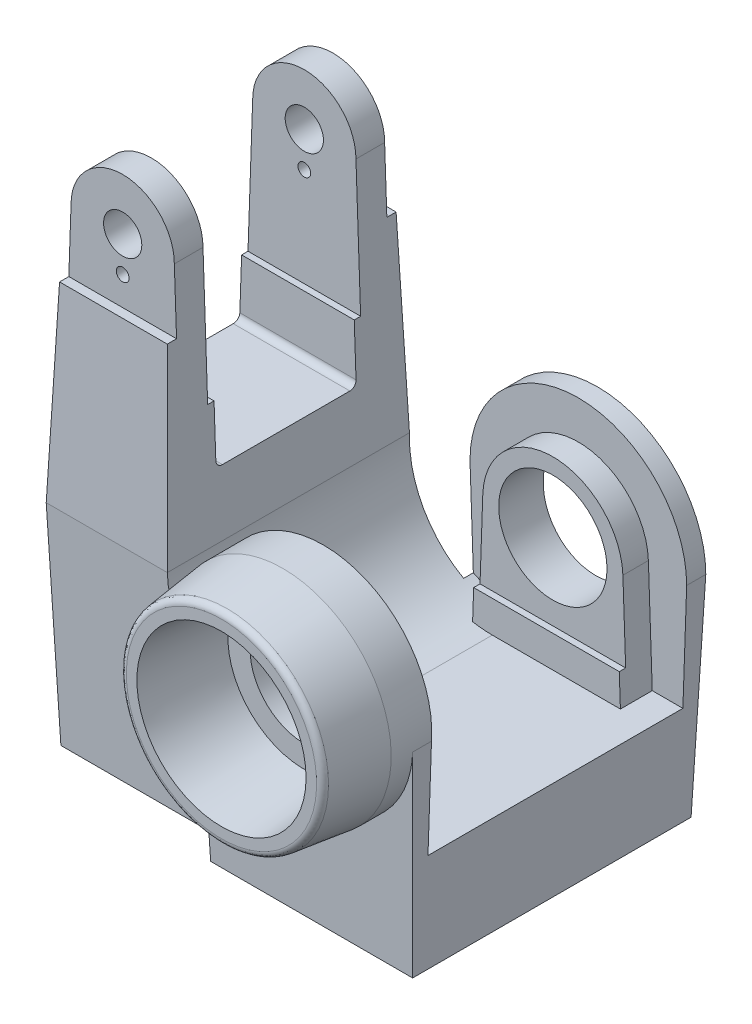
ISO-10303-21;
HEADER;
FILE_DESCRIPTION(('STEP AP214'),'2;1');
FILE_NAME('part.step','',(''),(''),'','','');
FILE_SCHEMA(('AUTOMOTIVE_DESIGN { 1 0 10303 214 1 1 1 1 }'));
ENDSEC;
DATA;
#1=APPLICATION_CONTEXT('core data for automotive mechanical design processes');
#2=APPLICATION_PROTOCOL_DEFINITION('international standard','automotive_design',2000,#1);
#3=PRODUCT_CONTEXT('',#1,'mechanical');
#4=PRODUCT('Part','Part','',(#3));
#5=PRODUCT_RELATED_PRODUCT_CATEGORY('part','',(#4));
#6=PRODUCT_DEFINITION_FORMATION('','',#4);
#7=PRODUCT_DEFINITION_CONTEXT('part definition',#1,'design');
#8=PRODUCT_DEFINITION('design','',#6,#7);
#9=PRODUCT_DEFINITION_SHAPE('','',#8);
#10=(LENGTH_UNIT() NAMED_UNIT(*) SI_UNIT(.MILLI.,.METRE.));
#11=(NAMED_UNIT(*) PLANE_ANGLE_UNIT() SI_UNIT($,.RADIAN.));
#12=(NAMED_UNIT(*) SI_UNIT($,.STERADIAN.) SOLID_ANGLE_UNIT());
#13=UNCERTAINTY_MEASURE_WITH_UNIT(LENGTH_MEASURE(1.E-05),#10,'distance_accuracy_value','');
#14=(GEOMETRIC_REPRESENTATION_CONTEXT(3) GLOBAL_UNCERTAINTY_ASSIGNED_CONTEXT((#13)) GLOBAL_UNIT_ASSIGNED_CONTEXT((#10,
#11,#12)) REPRESENTATION_CONTEXT('',''));
#15=CARTESIAN_POINT('',(0.,0.,0.));
#16=DIRECTION('',(0.,0.,1.));
#17=DIRECTION('',(1.,0.,0.));
#18=AXIS2_PLACEMENT_3D('',#15,#16,#17);
#19=CARTESIAN_POINT('',(0.,0.,72.));
#20=DIRECTION('',(0.,0.,1.));
#21=DIRECTION('',(1.,0.,0.));
#22=AXIS2_PLACEMENT_3D('',#19,#20,#21);
#23=CONICAL_SURFACE('',#22,26.5548828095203,0.0979502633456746);
#24=CARTESIAN_POINT('',(0.,0.,46.));
#25=DIRECTION('',(0.,0.,1.));
#26=DIRECTION('',(1.,0.,0.));
#27=AXIS2_PLACEMENT_3D('',#24,#25,#26);
#28=CIRCLE('',#27,24.);
#29=CARTESIAN_POINT('',(24.,0.,46.));
#30=VERTEX_POINT('',#29);
#31=EDGE_CURVE('E794',#30,#30,#28,.T.);
#32=ORIENTED_EDGE('',*,*,#31,.F.);
#33=EDGE_LOOP('',(#32));
#34=FACE_BOUND('',#33,.T.);
#35=CARTESIAN_POINT('',(0.,0.,72.));
#36=DIRECTION('',(0.,0.,1.));
#37=DIRECTION('',(1.,0.,0.));
#38=AXIS2_PLACEMENT_3D('',#35,#36,#37);
#39=CIRCLE('',#38,26.5548828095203);
#40=CARTESIAN_POINT('',(26.5548828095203,0.,72.));
#41=VERTEX_POINT('',#40);
#42=EDGE_CURVE('E798',#41,#41,#39,.F.);
#43=ORIENTED_EDGE('',*,*,#42,.F.);
#44=EDGE_LOOP('',(#43));
#45=FACE_BOUND('',#44,.T.);
#46=ADVANCED_FACE('F16',(#34,#45),#23,.F.);
#47=CARTESIAN_POINT('',(-6.6066842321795,-41.712962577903,72.));
#48=DIRECTION('',(0.,0.,1.));
#49=DIRECTION('',(0.809016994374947,0.587785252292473,0.));
#50=AXIS2_PLACEMENT_3D('',#47,#48,#49);
#51=PLANE('',#50);
#52=ORIENTED_EDGE('',*,*,#42,.T.);
#53=EDGE_LOOP('',(#52));
#54=FACE_BOUND('',#53,.T.);
#55=CARTESIAN_POINT('',(0.,0.,72.));
#56=DIRECTION('',(0.,0.,-1.));
#57=DIRECTION('',(0.809016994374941,0.587785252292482,0.));
#58=AXIS2_PLACEMENT_3D('',#55,#56,#57);
#59=CIRCLE('',#58,29.8631840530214);
#60=CARTESIAN_POINT('',(24.159823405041,17.553139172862,72.));
#61=VERTEX_POINT('',#60);
#62=EDGE_CURVE('E335',#61,#61,#59,.T.);
#63=ORIENTED_EDGE('',*,*,#62,.F.);
#64=EDGE_LOOP('',(#63));
#65=FACE_BOUND('',#64,.T.);
#66=ADVANCED_FACE('F340',(#54,#65),#51,.T.);
#67=CARTESIAN_POINT('',(-33.5232539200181,-33.5232539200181,46.));
#68=DIRECTION('',(0.,0.,1.));
#69=DIRECTION('',(1.,0.,0.));
#70=AXIS2_PLACEMENT_3D('',#67,#68,#69);
#71=PLANE('',#70);
#72=CARTESIAN_POINT('',(0.,0.,46.));
#73=DIRECTION('',(0.,0.,1.));
#74=DIRECTION('',(1.,0.,0.));
#75=AXIS2_PLACEMENT_3D('',#72,#73,#74);
#76=CIRCLE('',#75,17.);
#77=CARTESIAN_POINT('',(17.,0.,46.));
#78=VERTEX_POINT('',#77);
#79=EDGE_CURVE('E786',#78,#78,#76,.T.);
#80=ORIENTED_EDGE('',*,*,#79,.F.);
#81=EDGE_LOOP('',(#80));
#82=FACE_BOUND('',#81,.T.);
#83=ORIENTED_EDGE('',*,*,#31,.T.);
#84=EDGE_LOOP('',(#83));
#85=FACE_BOUND('',#84,.T.);
#86=ADVANCED_FACE('F350',(#82,#85),#71,.T.);
#87=CARTESIAN_POINT('',(25.777857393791,18.728709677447,70.));
#88=CARTESIAN_POINT('',(25.777857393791,18.728709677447,72.));
#89=CARTESIAN_POINT('',(24.159823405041,17.553139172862,72.));
#90=CARTESIAN_POINT('',(22.541789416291,16.377568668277,72.));
#91=CARTESIAN_POINT('',(22.541789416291,16.377568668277,70.));
#92=(BOUNDED_CURVE() B_SPLINE_CURVE(2,(#87,#88,#89,#90,#91),.UNSPECIFIED.,.F.,
.F.) B_SPLINE_CURVE_WITH_KNOTS((3,2,3),(0.,0.25,0.5),
.UNSPECIFIED.) CURVE() GEOMETRIC_REPRESENTATION_ITEM() RATIONAL_B_SPLINE_CURVE((1.,
0.70710678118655,1.,0.70710678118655,1.)) REPRESENTATION_ITEM(''));
#93=CARTESIAN_POINT('',(0.,0.,72.));
#94=DIRECTION('',(0.,0.,-1.));
#95=AXIS1_PLACEMENT('',#93,#94);
#96=SURFACE_OF_REVOLUTION('',#92,#95);
#97=ORIENTED_EDGE('',*,*,#62,.T.);
#98=EDGE_LOOP('',(#97));
#99=FACE_BOUND('',#98,.T.);
#100=CARTESIAN_POINT('',(0.,0.,70.243871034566));
#101=DIRECTION('',(0.,0.,-1.));
#102=DIRECTION('',(0.,1.,0.));
#103=AXIS2_PLACEMENT_3D('',#100,#101,#102);
#104=CIRCLE('',#103,31.8482601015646);
#105=CARTESIAN_POINT('',(0.,31.8482601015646,70.243871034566));
#106=VERTEX_POINT('',#105);
#107=EDGE_CURVE('E782',#106,#106,#104,.F.);
#108=ORIENTED_EDGE('',*,*,#107,.T.);
#109=EDGE_LOOP('',(#108));
#110=FACE_BOUND('',#109,.T.);
#111=ADVANCED_FACE('F356',(#99,#110),#96,.F.);
#112=CARTESIAN_POINT('',(0.,0.,31.9999999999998));
#113=DIRECTION('',(0.,0.,1.));
#114=DIRECTION('',(1.,0.,0.));
#115=AXIS2_PLACEMENT_3D('',#112,#113,#114);
#116=CYLINDRICAL_SURFACE('',#115,17.);
#117=CARTESIAN_POINT('',(0.,0.,31.9999999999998));
#118=DIRECTION('',(0.,0.,1.));
#119=DIRECTION('',(1.,0.,0.));
#120=AXIS2_PLACEMENT_3D('',#117,#118,#119);
#121=CIRCLE('',#120,17.);
#122=CARTESIAN_POINT('',(17.,0.,31.9999999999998));
#123=VERTEX_POINT('',#122);
#124=EDGE_CURVE('E284',#123,#123,#121,.F.);
#125=ORIENTED_EDGE('',*,*,#124,.T.);
#126=EDGE_LOOP('',(#125));
#127=FACE_BOUND('',#126,.T.);
#128=ORIENTED_EDGE('',*,*,#79,.T.);
#129=EDGE_LOOP('',(#128));
#130=FACE_BOUND('',#129,.T.);
#131=ADVANCED_FACE('F815',(#127,#130),#116,.F.);
#132=CARTESIAN_POINT('',(0.,0.,70.243871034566));
#133=DIRECTION('',(0.,0.,-1.));
#134=DIRECTION('',(0.,1.,0.));
#135=AXIS2_PLACEMENT_3D('',#132,#133,#134);
#136=CONICAL_SURFACE('',#135,31.8482601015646,0.122239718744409);
#137=ORIENTED_EDGE('',*,*,#107,.F.);
#138=EDGE_LOOP('',(#137));
#139=FACE_BOUND('',#138,.T.);
#140=CARTESIAN_POINT('',(0.,0.,52.729009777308));
#141=DIRECTION('',(0.,0.,1.));
#142=DIRECTION('',(0.,-1.,0.));
#143=AXIS2_PLACEMENT_3D('',#140,#141,#142);
#144=CIRCLE('',#143,34.);
#145=CARTESIAN_POINT('',(0.,-34.,52.729009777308));
#146=VERTEX_POINT('',#145);
#147=EDGE_CURVE('E756',#146,#146,#144,.T.);
#148=ORIENTED_EDGE('',*,*,#147,.T.);
#149=EDGE_LOOP('',(#148));
#150=FACE_BOUND('',#149,.T.);
#151=ADVANCED_FACE('F1441',(#139,#150),#136,.T.);
#152=CARTESIAN_POINT('',(0.,0.,40.));
#153=DIRECTION('',(0.,0.,-1.));
#154=DIRECTION('',(-1.,0.,0.));
#155=AXIS2_PLACEMENT_3D('',#152,#153,#154);
#156=CYLINDRICAL_SURFACE('',#155,22.);
#157=CARTESIAN_POINT('',(0.,0.,40.));
#158=DIRECTION('',(0.,0.,-1.));
#159=DIRECTION('',(-1.,0.,0.));
#160=AXIS2_PLACEMENT_3D('',#157,#158,#159);
#161=CIRCLE('',#160,22.);
#162=CARTESIAN_POINT('',(21.98659819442,0.767788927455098,40.));
#163=VERTEX_POINT('',#162);
#164=CARTESIAN_POINT('',(-21.98659819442,0.767788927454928,40.0000000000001));
#165=VERTEX_POINT('',#164);
#166=EDGE_CURVE('E737',#163,#165,#161,.F.);
#167=ORIENTED_EDGE('',*,*,#166,.F.);
#168=DIRECTION('',(0.,0.,1.));
#169=VECTOR('',#168,1.);
#170=CARTESIAN_POINT('',(21.98659819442,0.76778892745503,47.394490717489));
#171=LINE('',#170,#169);
#172=CARTESIAN_POINT('',(21.98659819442,0.767788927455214,32.));
#173=VERTEX_POINT('',#172);
#174=EDGE_CURVE('E291',#173,#163,#171,.T.);
#175=ORIENTED_EDGE('',*,*,#174,.F.);
#176=CARTESIAN_POINT('',(0.,0.,32.));
#177=DIRECTION('',(0.,0.,-1.));
#178=DIRECTION('',(-1.,0.,0.));
#179=AXIS2_PLACEMENT_3D('',#176,#177,#178);
#180=CIRCLE('',#179,22.);
#181=CARTESIAN_POINT('',(-21.98659819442,0.767788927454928,32.));
#182=VERTEX_POINT('',#181);
#183=EDGE_CURVE('E269',#173,#182,#180,.F.);
#184=ORIENTED_EDGE('',*,*,#183,.T.);
#185=DIRECTION('',(0.,0.,-1.));
#186=VECTOR('',#185,1.);
#187=CARTESIAN_POINT('',(-21.98659819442,0.76778892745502,47.1110467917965));
#188=LINE('',#187,#186);
#189=EDGE_CURVE('E313',#165,#182,#188,.T.);
#190=ORIENTED_EDGE('',*,*,#189,.F.);
#191=EDGE_LOOP('',(#167,#175,#184,#190));
#192=FACE_BOUND('',#191,.T.);
#193=ADVANCED_FACE('F360',(#192),#156,.T.);
#194=CARTESIAN_POINT('',(22.851508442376,22.,32.));
#195=DIRECTION('',(0.,0.,1.));
#196=DIRECTION('',(-1.,0.,0.));
#197=AXIS2_PLACEMENT_3D('',#194,#195,#196);
#198=PLANE('',#197);
#199=ORIENTED_EDGE('',*,*,#124,.F.);
#200=EDGE_LOOP('',(#199));
#201=FACE_BOUND('',#200,.T.);
#202=DIRECTION('',(-0.0348994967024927,-0.999390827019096,0.));
#203=VECTOR('',#202,1.);
#204=CARTESIAN_POINT('',(-22.5837651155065,-16.332834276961,32.));
#205=LINE('',#204,#203);
#206=CARTESIAN_POINT('',(-22.8515084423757,-24.0000000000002,32.));
#207=VERTEX_POINT('',#206);
#208=EDGE_CURVE('E310',#182,#207,#205,.T.);
#209=ORIENTED_EDGE('',*,*,#208,.F.);
#210=ORIENTED_EDGE('',*,*,#183,.F.);
#211=DIRECTION('',(-0.0348994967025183,0.999390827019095,0.));
#212=VECTOR('',#211,1.);
#213=CARTESIAN_POINT('',(22.593657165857,-16.6161055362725,32.));
#214=LINE('',#213,#212);
#215=CARTESIAN_POINT('',(22.8515084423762,-24.,32.));
#216=VERTEX_POINT('',#215);
#217=EDGE_CURVE('E287',#216,#173,#214,.T.);
#218=ORIENTED_EDGE('',*,*,#217,.F.);
#219=DIRECTION('',(-1.,0.,0.));
#220=VECTOR('',#219,1.);
#221=CARTESIAN_POINT('',(-9.14849155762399,-24.,32.));
#222=LINE('',#221,#220);
#223=EDGE_CURVE('E275',#216,#207,#222,.T.);
#224=ORIENTED_EDGE('',*,*,#223,.T.);
#225=EDGE_LOOP('',(#209,#210,#218,#224));
#226=FACE_BOUND('',#225,.T.);
#227=ADVANCED_FACE('F288',(#201,#226),#198,.F.);
#228=CARTESIAN_POINT('',(22.851508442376,-24.,32.));
#229=DIRECTION('',(0.,-1.,0.));
#230=DIRECTION('',(-1.,0.,0.));
#231=AXIS2_PLACEMENT_3D('',#228,#229,#230);
#232=PLANE('',#231);
#233=DIRECTION('',(0.,0.,1.));
#234=VECTOR('',#233,1.);
#235=CARTESIAN_POINT('',(22.8515084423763,-24.,47.394490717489));
#236=LINE('',#235,#234);
#237=CARTESIAN_POINT('',(22.8515084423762,-24.0000000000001,30.));
#238=VERTEX_POINT('',#237);
#239=EDGE_CURVE('E279',#238,#216,#236,.T.);
#240=ORIENTED_EDGE('',*,*,#239,.F.);
#241=DIRECTION('',(1.,0.,0.));
#242=VECTOR('',#241,1.);
#243=CARTESIAN_POINT('',(-22.8515084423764,-24.0000000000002,30.));
#244=LINE('',#243,#242);
#245=CARTESIAN_POINT('',(-22.8515084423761,-24.0000000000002,30.));
#246=VERTEX_POINT('',#245);
#247=EDGE_CURVE('E727',#246,#238,#244,.T.);
#248=ORIENTED_EDGE('',*,*,#247,.F.);
#249=DIRECTION('',(0.,0.,-1.));
#250=VECTOR('',#249,1.);
#251=CARTESIAN_POINT('',(-22.8515084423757,-24.0000000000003,47.1110467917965));
#252=LINE('',#251,#250);
#253=EDGE_CURVE('E281',#207,#246,#252,.T.);
#254=ORIENTED_EDGE('',*,*,#253,.F.);
#255=ORIENTED_EDGE('',*,*,#223,.F.);
#256=EDGE_LOOP('',(#240,#248,#254,#255));
#257=FACE_BOUND('',#256,.T.);
#258=ADVANCED_FACE('F276',(#257),#232,.F.);
#259=CARTESIAN_POINT('',(21.98659819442,0.76778892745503,30.));
#260=DIRECTION('',(0.999390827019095,0.0348994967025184,0.));
#261=DIRECTION('',(0.,0.,1.));
#262=AXIS2_PLACEMENT_3D('',#259,#260,#261);
#263=PLANE('',#262);
#264=DIRECTION('',(-0.0348994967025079,0.999390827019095,0.));
#265=VECTOR('',#264,1.);
#266=CARTESIAN_POINT('',(23.2007161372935,-33.9999999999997,40.));
#267=LINE('',#266,#265);
#268=CARTESIAN_POINT('',(23.2007161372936,-34.,40.));
#269=VERTEX_POINT('',#268);
#270=EDGE_CURVE('E740',#269,#163,#267,.T.);
#271=ORIENTED_EDGE('',*,*,#270,.F.);
#272=DIRECTION('',(0.,0.,-1.));
#273=VECTOR('',#272,1.);
#274=CARTESIAN_POINT('',(23.2007161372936,-34.,0.));
#275=LINE('',#274,#273);
#276=CARTESIAN_POINT('',(23.2007161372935,-34.,30.));
#277=VERTEX_POINT('',#276);
#278=EDGE_CURVE('E1016',#269,#277,#275,.T.);
#279=ORIENTED_EDGE('',*,*,#278,.T.);
#280=DIRECTION('',(0.0348994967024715,-0.999390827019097,0.));
#281=VECTOR('',#280,1.);
#282=CARTESIAN_POINT('',(22.8515084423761,-24.0000000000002,30.));
#283=LINE('',#282,#281);
#284=EDGE_CURVE('E295',#238,#277,#283,.T.);
#285=ORIENTED_EDGE('',*,*,#284,.F.);
#286=ORIENTED_EDGE('',*,*,#239,.T.);
#287=ORIENTED_EDGE('',*,*,#217,.T.);
#288=ORIENTED_EDGE('',*,*,#174,.T.);
#289=EDGE_LOOP('',(#271,#279,#285,#286,#287,#288));
#290=FACE_BOUND('',#289,.T.);
#291=ADVANCED_FACE('F293',(#290),#263,.T.);
#292=CARTESIAN_POINT('',(23.200716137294,-34.,-30.));
#293=DIRECTION('',(0.999390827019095,0.0348994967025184,0.));
#294=DIRECTION('',(0.,0.,-1.));
#295=AXIS2_PLACEMENT_3D('',#292,#293,#294);
#296=PLANE('',#295);
#297=DIRECTION('',(-0.0348994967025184,0.999390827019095,0.));
#298=VECTOR('',#297,1.);
#299=CARTESIAN_POINT('',(23.200716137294,-34.,-32.));
#300=LINE('',#299,#298);
#301=CARTESIAN_POINT('',(21.98659819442,0.767788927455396,-32.));
#302=VERTEX_POINT('',#301);
#303=CARTESIAN_POINT('',(22.8515084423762,-24.,-32.));
#304=VERTEX_POINT('',#303);
#305=EDGE_CURVE('E772',#302,#304,#300,.F.);
#306=ORIENTED_EDGE('',*,*,#305,.T.);
#307=DIRECTION('',(0.,0.,1.));
#308=VECTOR('',#307,1.);
#309=CARTESIAN_POINT('',(22.851508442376,-24.,0.));
#310=LINE('',#309,#308);
#311=CARTESIAN_POINT('',(22.8515084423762,-23.9999999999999,-30.));
#312=VERTEX_POINT('',#311);
#313=EDGE_CURVE('E322',#304,#312,#310,.T.);
#314=ORIENTED_EDGE('',*,*,#313,.T.);
#315=DIRECTION('',(-0.0348994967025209,0.999390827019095,0.));
#316=VECTOR('',#315,1.);
#317=CARTESIAN_POINT('',(23.200716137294,-34.,-30.));
#318=LINE('',#317,#316);
#319=CARTESIAN_POINT('',(23.2007161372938,-34.,-30.));
#320=VERTEX_POINT('',#319);
#321=EDGE_CURVE('E721',#320,#312,#318,.T.);
#322=ORIENTED_EDGE('',*,*,#321,.F.);
#323=DIRECTION('',(0.,0.,-1.));
#324=VECTOR('',#323,1.);
#325=CARTESIAN_POINT('',(23.2007161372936,-34.,0.));
#326=LINE('',#325,#324);
#327=CARTESIAN_POINT('',(23.2007161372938,-34.,-40.));
#328=VERTEX_POINT('',#327);
#329=EDGE_CURVE('E1015',#320,#328,#326,.T.);
#330=ORIENTED_EDGE('',*,*,#329,.T.);
#331=DIRECTION('',(-0.0348994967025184,0.999390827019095,0.));
#332=VECTOR('',#331,1.);
#333=CARTESIAN_POINT('',(23.200716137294,-34.,-40.));
#334=LINE('',#333,#332);
#335=CARTESIAN_POINT('',(21.98659819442,0.767788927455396,-40.));
#336=VERTEX_POINT('',#335);
#337=EDGE_CURVE('E753',#328,#336,#334,.T.);
#338=ORIENTED_EDGE('',*,*,#337,.T.);
#339=DIRECTION('',(0.,0.,1.));
#340=VECTOR('',#339,1.);
#341=CARTESIAN_POINT('',(21.9865981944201,0.767788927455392,-36.));
#342=LINE('',#341,#340);
#343=EDGE_CURVE('E323',#336,#302,#342,.T.);
#344=ORIENTED_EDGE('',*,*,#343,.T.);
#345=EDGE_LOOP('',(#306,#314,#322,#330,#338,#344));
#346=FACE_BOUND('',#345,.T.);
#347=ADVANCED_FACE('F366',(#346),#296,.T.);
#348=CARTESIAN_POINT('',(22.851508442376,-24.,32.));
#349=DIRECTION('',(0.,-1.,0.));
#350=DIRECTION('',(-1.,0.,0.));
#351=AXIS2_PLACEMENT_3D('',#348,#349,#350);
#352=PLANE('',#351);
#353=DIRECTION('',(0.,0.,-1.));
#354=VECTOR('',#353,1.);
#355=CARTESIAN_POINT('',(-22.8515084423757,-24.0000000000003,-47.1110467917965));
#356=LINE('',#355,#354);
#357=CARTESIAN_POINT('',(-22.8515084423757,-24.0000000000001,-30.));
#358=VERTEX_POINT('',#357);
#359=CARTESIAN_POINT('',(-22.8515084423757,-24.0000000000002,-32.));
#360=VERTEX_POINT('',#359);
#361=EDGE_CURVE('E1009',#358,#360,#356,.T.);
#362=ORIENTED_EDGE('',*,*,#361,.F.);
#363=DIRECTION('',(-1.,0.,0.));
#364=VECTOR('',#363,1.);
#365=CARTESIAN_POINT('',(0.00989205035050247,-23.9999999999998,-30.));
#366=LINE('',#365,#364);
#367=EDGE_CURVE('E725',#312,#358,#366,.T.);
#368=ORIENTED_EDGE('',*,*,#367,.F.);
#369=ORIENTED_EDGE('',*,*,#313,.F.);
#370=DIRECTION('',(-1.,0.,0.));
#371=VECTOR('',#370,1.);
#372=CARTESIAN_POINT('',(-0.148491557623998,-24.,-32.));
#373=LINE('',#372,#371);
#374=EDGE_CURVE('E771',#304,#360,#373,.T.);
#375=ORIENTED_EDGE('',*,*,#374,.T.);
#376=EDGE_LOOP('',(#362,#368,#369,#375));
#377=FACE_BOUND('',#376,.T.);
#378=ADVANCED_FACE('F369',(#377),#352,.F.);
#379=CARTESIAN_POINT('',(22.851508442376,-24.,-32.));
#380=DIRECTION('',(0.,0.,-1.));
#381=DIRECTION('',(-1.,0.,0.));
#382=AXIS2_PLACEMENT_3D('',#379,#380,#381);
#383=PLANE('',#382);
#384=CARTESIAN_POINT('',(0.,0.,-31.9999999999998));
#385=DIRECTION('',(0.,0.,1.));
#386=DIRECTION('',(1.,0.,0.));
#387=AXIS2_PLACEMENT_3D('',#384,#385,#386);
#388=CIRCLE('',#387,17.);
#389=CARTESIAN_POINT('',(17.,0.,-31.9999999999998));
#390=VERTEX_POINT('',#389);
#391=EDGE_CURVE('E326',#390,#390,#388,.T.);
#392=ORIENTED_EDGE('',*,*,#391,.F.);
#393=EDGE_LOOP('',(#392));
#394=FACE_BOUND('',#393,.T.);
#395=ORIENTED_EDGE('',*,*,#305,.F.);
#396=CARTESIAN_POINT('',(0.,0.,-32.));
#397=DIRECTION('',(0.,0.,1.));
#398=DIRECTION('',(1.,0.,0.));
#399=AXIS2_PLACEMENT_3D('',#396,#397,#398);
#400=CIRCLE('',#399,22.);
#401=CARTESIAN_POINT('',(-21.98659819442,0.767788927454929,-32.));
#402=VERTEX_POINT('',#401);
#403=EDGE_CURVE('E327',#302,#402,#400,.T.);
#404=ORIENTED_EDGE('',*,*,#403,.T.);
#405=DIRECTION('',(0.0348994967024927,0.999390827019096,0.));
#406=VECTOR('',#405,1.);
#407=CARTESIAN_POINT('',(-22.5837651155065,-16.332834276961,-32.));
#408=LINE('',#407,#406);
#409=EDGE_CURVE('E1098',#360,#402,#408,.T.);
#410=ORIENTED_EDGE('',*,*,#409,.F.);
#411=ORIENTED_EDGE('',*,*,#374,.F.);
#412=EDGE_LOOP('',(#395,#404,#410,#411));
#413=FACE_BOUND('',#412,.T.);
#414=ADVANCED_FACE('F373',(#394,#413),#383,.F.);
#415=CARTESIAN_POINT('',(0.,0.,-40.));
#416=DIRECTION('',(0.,0.,1.));
#417=DIRECTION('',(1.,0.,0.));
#418=AXIS2_PLACEMENT_3D('',#415,#416,#417);
#419=CYLINDRICAL_SURFACE('',#418,22.);
#420=CARTESIAN_POINT('',(0.,0.,-40.));
#421=DIRECTION('',(0.,0.,1.));
#422=DIRECTION('',(1.,0.,0.));
#423=AXIS2_PLACEMENT_3D('',#420,#421,#422);
#424=CIRCLE('',#423,22.);
#425=CARTESIAN_POINT('',(-21.98659819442,0.767788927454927,-40.0000000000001));
#426=VERTEX_POINT('',#425);
#427=EDGE_CURVE('E750',#336,#426,#424,.T.);
#428=ORIENTED_EDGE('',*,*,#427,.T.);
#429=DIRECTION('',(0.,0.,-1.));
#430=VECTOR('',#429,1.);
#431=CARTESIAN_POINT('',(-21.98659819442,0.76778892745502,-47.1110467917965));
#432=LINE('',#431,#430);
#433=EDGE_CURVE('E1033',#402,#426,#432,.T.);
#434=ORIENTED_EDGE('',*,*,#433,.F.);
#435=ORIENTED_EDGE('',*,*,#403,.F.);
#436=ORIENTED_EDGE('',*,*,#343,.F.);
#437=EDGE_LOOP('',(#428,#434,#435,#436));
#438=FACE_BOUND('',#437,.T.);
#439=ADVANCED_FACE('F377',(#438),#419,.T.);
#440=CARTESIAN_POINT('',(-70.,80.,-33.));
#441=DIRECTION('',(0.,0.,1.));
#442=DIRECTION('',(1.,0.,0.));
#443=AXIS2_PLACEMENT_3D('',#440,#441,#442);
#444=CYLINDRICAL_SURFACE('',#443,6.00000000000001);
#445=CARTESIAN_POINT('',(-70.,80.,-23.9999999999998));
#446=DIRECTION('',(0.,0.,1.));
#447=DIRECTION('',(1.,0.,0.));
#448=AXIS2_PLACEMENT_3D('',#445,#446,#447);
#449=CIRCLE('',#448,6.00000000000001);
#450=CARTESIAN_POINT('',(-64.,80.,-23.9999999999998));
#451=VERTEX_POINT('',#450);
#452=EDGE_CURVE('E668',#451,#451,#449,.T.);
#453=ORIENTED_EDGE('',*,*,#452,.T.);
#454=EDGE_LOOP('',(#453));
#455=FACE_BOUND('',#454,.T.);
#456=CARTESIAN_POINT('',(-70.,80.,-33.));
#457=DIRECTION('',(0.,0.,1.));
#458=DIRECTION('',(1.,0.,0.));
#459=AXIS2_PLACEMENT_3D('',#456,#457,#458);
#460=CIRCLE('',#459,6.00000000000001);
#461=CARTESIAN_POINT('',(-64.,80.,-33.));
#462=VERTEX_POINT('',#461);
#463=EDGE_CURVE('E646',#462,#462,#460,.F.);
#464=ORIENTED_EDGE('',*,*,#463,.T.);
#465=EDGE_LOOP('',(#464));
#466=FACE_BOUND('',#465,.T.);
#467=ADVANCED_FACE('F1412',(#455,#466),#444,.F.);
#468=CARTESIAN_POINT('',(-70.,69.,-33.));
#469=DIRECTION('',(0.,0.,1.));
#470=DIRECTION('',(1.,0.,0.));
#471=AXIS2_PLACEMENT_3D('',#468,#469,#470);
#472=CYLINDRICAL_SURFACE('',#471,2.);
#473=CARTESIAN_POINT('',(-70.,69.,-23.9999999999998));
#474=DIRECTION('',(0.,0.,1.));
#475=DIRECTION('',(1.,0.,0.));
#476=AXIS2_PLACEMENT_3D('',#473,#474,#475);
#477=CIRCLE('',#476,2.);
#478=CARTESIAN_POINT('',(-68.,69.,-23.9999999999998));
#479=VERTEX_POINT('',#478);
#480=EDGE_CURVE('E664',#479,#479,#477,.T.);
#481=ORIENTED_EDGE('',*,*,#480,.T.);
#482=EDGE_LOOP('',(#481));
#483=FACE_BOUND('',#482,.T.);
#484=CARTESIAN_POINT('',(-70.,69.,-33.));
#485=DIRECTION('',(0.,0.,1.));
#486=DIRECTION('',(1.,0.,0.));
#487=AXIS2_PLACEMENT_3D('',#484,#485,#486);
#488=CIRCLE('',#487,2.);
#489=CARTESIAN_POINT('',(-68.,69.,-33.));
#490=VERTEX_POINT('',#489);
#491=EDGE_CURVE('E641',#490,#490,#488,.F.);
#492=ORIENTED_EDGE('',*,*,#491,.T.);
#493=EDGE_LOOP('',(#492));
#494=FACE_BOUND('',#493,.T.);
#495=ADVANCED_FACE('F1403',(#483,#494),#472,.F.);
#496=CARTESIAN_POINT('',(-70.,80.,23.9999999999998));
#497=DIRECTION('',(0.,0.,1.));
#498=DIRECTION('',(1.,0.,0.));
#499=AXIS2_PLACEMENT_3D('',#496,#497,#498);
#500=CYLINDRICAL_SURFACE('',#499,6.00000000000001);
#501=CARTESIAN_POINT('',(-70.,80.,23.9999999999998));
#502=DIRECTION('',(0.,0.,1.));
#503=DIRECTION('',(1.,0.,0.));
#504=AXIS2_PLACEMENT_3D('',#501,#502,#503);
#505=CIRCLE('',#504,6.00000000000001);
#506=CARTESIAN_POINT('',(-64.,80.,23.9999999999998));
#507=VERTEX_POINT('',#506);
#508=EDGE_CURVE('E706',#507,#507,#505,.F.);
#509=ORIENTED_EDGE('',*,*,#508,.T.);
#510=EDGE_LOOP('',(#509));
#511=FACE_BOUND('',#510,.T.);
#512=CARTESIAN_POINT('',(-70.,80.,33.));
#513=DIRECTION('',(0.,0.,1.));
#514=DIRECTION('',(1.,0.,0.));
#515=AXIS2_PLACEMENT_3D('',#512,#513,#514);
#516=CIRCLE('',#515,6.00000000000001);
#517=CARTESIAN_POINT('',(-64.,80.,33.));
#518=VERTEX_POINT('',#517);
#519=EDGE_CURVE('E624',#518,#518,#516,.T.);
#520=ORIENTED_EDGE('',*,*,#519,.T.);
#521=EDGE_LOOP('',(#520));
#522=FACE_BOUND('',#521,.T.);
#523=ADVANCED_FACE('F1235',(#511,#522),#500,.F.);
#524=CARTESIAN_POINT('',(-70.,69.,23.9999999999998));
#525=DIRECTION('',(0.,0.,1.));
#526=DIRECTION('',(1.,0.,0.));
#527=AXIS2_PLACEMENT_3D('',#524,#525,#526);
#528=CYLINDRICAL_SURFACE('',#527,2.);
#529=CARTESIAN_POINT('',(-70.,69.,23.9999999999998));
#530=DIRECTION('',(0.,0.,1.));
#531=DIRECTION('',(1.,0.,0.));
#532=AXIS2_PLACEMENT_3D('',#529,#530,#531);
#533=CIRCLE('',#532,2.);
#534=CARTESIAN_POINT('',(-68.,69.,23.9999999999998));
#535=VERTEX_POINT('',#534);
#536=EDGE_CURVE('E701',#535,#535,#533,.F.);
#537=ORIENTED_EDGE('',*,*,#536,.T.);
#538=EDGE_LOOP('',(#537));
#539=FACE_BOUND('',#538,.T.);
#540=CARTESIAN_POINT('',(-70.,69.,33.));
#541=DIRECTION('',(0.,0.,1.));
#542=DIRECTION('',(1.,0.,0.));
#543=AXIS2_PLACEMENT_3D('',#540,#541,#542);
#544=CIRCLE('',#543,2.);
#545=CARTESIAN_POINT('',(-68.,69.,33.));
#546=VERTEX_POINT('',#545);
#547=EDGE_CURVE('E620',#546,#546,#544,.T.);
#548=ORIENTED_EDGE('',*,*,#547,.T.);
#549=EDGE_LOOP('',(#548));
#550=FACE_BOUND('',#549,.T.);
#551=ADVANCED_FACE('F1229',(#539,#550),#528,.F.);
#552=CARTESIAN_POINT('',(0.,0.,-46.));
#553=DIRECTION('',(0.,0.,1.));
#554=DIRECTION('',(1.,0.,0.));
#555=AXIS2_PLACEMENT_3D('',#552,#553,#554);
#556=CYLINDRICAL_SURFACE('',#555,17.);
#557=ORIENTED_EDGE('',*,*,#391,.T.);
#558=EDGE_LOOP('',(#557));
#559=FACE_BOUND('',#558,.T.);
#560=CARTESIAN_POINT('',(0.,0.,-46.));
#561=DIRECTION('',(0.,-0.0348994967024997,-0.999390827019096));
#562=DIRECTION('',(0.,-0.999390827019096,0.0348994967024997));
#563=AXIS2_PLACEMENT_3D('',#560,#561,#562);
#564=ELLIPSE('',#563,17.01036225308,17.);
#565=CARTESIAN_POINT('',(-17.,0.,-46.));
#566=VERTEX_POINT('',#565);
#567=CARTESIAN_POINT('',(17.,0.,-46.));
#568=VERTEX_POINT('',#567);
#569=EDGE_CURVE('E610',#566,#568,#564,.F.);
#570=ORIENTED_EDGE('',*,*,#569,.F.);
#571=CARTESIAN_POINT('',(0.,0.,-46.));
#572=DIRECTION('',(0.,0.,1.));
#573=DIRECTION('',(1.,0.,0.));
#574=AXIS2_PLACEMENT_3D('',#571,#572,#573);
#575=CIRCLE('',#574,17.);
#576=EDGE_CURVE('E760',#568,#566,#575,.T.);
#577=ORIENTED_EDGE('',*,*,#576,.F.);
#578=EDGE_LOOP('',(#570,#577));
#579=FACE_BOUND('',#578,.T.);
#580=ADVANCED_FACE('F383',(#559,#579),#556,.F.);
#581=CARTESIAN_POINT('',(34.,0.,-46.));
#582=DIRECTION('',(0.,0.,-1.));
#583=DIRECTION('',(-1.,0.,0.));
#584=AXIS2_PLACEMENT_3D('',#581,#582,#583);
#585=PLANE('',#584);
#586=ORIENTED_EDGE('',*,*,#576,.T.);
#587=DIRECTION('',(1.,0.,0.));
#588=VECTOR('',#587,1.);
#589=CARTESIAN_POINT('',(0.,0.,-46.));
#590=LINE('',#589,#588);
#591=CARTESIAN_POINT('',(-34.,-1.71557050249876E-13,-46.));
#592=VERTEX_POINT('',#591);
#593=EDGE_CURVE('E614',#592,#566,#590,.T.);
#594=ORIENTED_EDGE('',*,*,#593,.F.);
#595=CARTESIAN_POINT('',(0.,0.,-46.));
#596=DIRECTION('',(0.,0.,1.));
#597=DIRECTION('',(1.,0.,0.));
#598=AXIS2_PLACEMENT_3D('',#595,#596,#597);
#599=CIRCLE('',#598,34.);
#600=CARTESIAN_POINT('',(34.,0.,-46.));
#601=VERTEX_POINT('',#600);
#602=EDGE_CURVE('E757',#592,#601,#599,.F.);
#603=ORIENTED_EDGE('',*,*,#602,.T.);
#604=DIRECTION('',(1.,0.,0.));
#605=VECTOR('',#604,1.);
#606=CARTESIAN_POINT('',(0.,0.,-46.));
#607=LINE('',#606,#605);
#608=EDGE_CURVE('E609',#568,#601,#607,.T.);
#609=ORIENTED_EDGE('',*,*,#608,.F.);
#610=EDGE_LOOP('',(#586,#594,#603,#609));
#611=FACE_BOUND('',#610,.T.);
#612=ADVANCED_FACE('F379',(#611),#585,.T.);
#613=CARTESIAN_POINT('',(0.,0.,-46.));
#614=DIRECTION('',(0.,0.,1.));
#615=DIRECTION('',(1.,0.,0.));
#616=AXIS2_PLACEMENT_3D('',#613,#614,#615);
#617=CYLINDRICAL_SURFACE('',#616,34.);
#618=ORIENTED_EDGE('',*,*,#602,.F.);
#619=DIRECTION('',(0.,0.,-1.));
#620=VECTOR('',#619,1.);
#621=CARTESIAN_POINT('',(-34.,0.,-0.0414111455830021));
#622=LINE('',#621,#620);
#623=CARTESIAN_POINT('',(-34.,0.,-40.));
#624=VERTEX_POINT('',#623);
#625=EDGE_CURVE('E910',#624,#592,#622,.T.);
#626=ORIENTED_EDGE('',*,*,#625,.F.);
#627=CARTESIAN_POINT('',(0.,0.,-40.));
#628=DIRECTION('',(0.,0.,1.));
#629=DIRECTION('',(1.,0.,0.));
#630=AXIS2_PLACEMENT_3D('',#627,#628,#629);
#631=CIRCLE('',#630,34.);
#632=CARTESIAN_POINT('',(34.,0.,-39.9999999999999));
#633=VERTEX_POINT('',#632);
#634=EDGE_CURVE('E747',#624,#633,#631,.F.);
#635=ORIENTED_EDGE('',*,*,#634,.T.);
#636=DIRECTION('',(0.,0.,1.));
#637=VECTOR('',#636,1.);
#638=CARTESIAN_POINT('',(34.,0.,-0.0414111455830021));
#639=LINE('',#638,#637);
#640=EDGE_CURVE('E608',#601,#633,#639,.T.);
#641=ORIENTED_EDGE('',*,*,#640,.F.);
#642=EDGE_LOOP('',(#618,#626,#635,#641));
#643=FACE_BOUND('',#642,.T.);
#644=ADVANCED_FACE('F382',(#643),#617,.T.);
#645=CARTESIAN_POINT('',(0.,0.,40.));
#646=DIRECTION('',(0.,0.,1.));
#647=DIRECTION('',(1.,0.,0.));
#648=AXIS2_PLACEMENT_3D('',#645,#646,#647);
#649=CYLINDRICAL_SURFACE('',#648,34.);
#650=CARTESIAN_POINT('',(0.,0.,46.));
#651=DIRECTION('',(0.,-0.034899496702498,0.999390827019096));
#652=DIRECTION('',(0.,0.999390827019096,0.034899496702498));
#653=AXIS2_PLACEMENT_3D('',#650,#651,#652);
#654=ELLIPSE('',#653,34.0207245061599,34.);
#655=CARTESIAN_POINT('',(33.917177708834,-2.37172010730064,45.917177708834));
#656=VERTEX_POINT('',#655);
#657=CARTESIAN_POINT('',(-33.917177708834,-2.37172010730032,45.917177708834));
#658=VERTEX_POINT('',#657);
#659=EDGE_CURVE('E592',#656,#658,#654,.F.);
#660=ORIENTED_EDGE('',*,*,#659,.F.);
#661=DIRECTION('',(0.,0.,1.));
#662=VECTOR('',#661,1.);
#663=CARTESIAN_POINT('',(33.917177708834,-2.37172010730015,-0.0414111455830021));
#664=LINE('',#663,#662);
#665=CARTESIAN_POINT('',(33.917177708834,-2.37172010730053,40.));
#666=VERTEX_POINT('',#665);
#667=EDGE_CURVE('E603',#666,#656,#664,.T.);
#668=ORIENTED_EDGE('',*,*,#667,.F.);
#669=CARTESIAN_POINT('',(0.,0.,40.));
#670=DIRECTION('',(0.,0.,1.));
#671=DIRECTION('',(1.,0.,0.));
#672=AXIS2_PLACEMENT_3D('',#669,#670,#671);
#673=CIRCLE('',#672,34.);
#674=CARTESIAN_POINT('',(-33.917177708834,-2.3717201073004,39.9999999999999));
#675=VERTEX_POINT('',#674);
#676=EDGE_CURVE('E744',#675,#666,#673,.F.);
#677=ORIENTED_EDGE('',*,*,#676,.F.);
#678=DIRECTION('',(0.,0.,-1.));
#679=VECTOR('',#678,1.);
#680=CARTESIAN_POINT('',(-33.917177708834,-2.37172010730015,-0.0414111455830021));
#681=LINE('',#680,#679);
#682=EDGE_CURVE('E586',#658,#675,#681,.T.);
#683=ORIENTED_EDGE('',*,*,#682,.F.);
#684=EDGE_LOOP('',(#660,#668,#677,#683));
#685=FACE_BOUND('',#684,.T.);
#686=ORIENTED_EDGE('',*,*,#147,.F.);
#687=EDGE_LOOP('',(#686));
#688=FACE_BOUND('',#687,.T.);
#689=ADVANCED_FACE('F389',(#685,#688),#649,.T.);
#690=CARTESIAN_POINT('',(34.,-34.,-40.));
#691=DIRECTION('',(0.,0.,-1.));
#692=DIRECTION('',(-1.,0.,0.));
#693=AXIS2_PLACEMENT_3D('',#690,#691,#692);
#694=PLANE('',#693);
#695=DIRECTION('',(-0.0348994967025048,-0.999390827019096,0.));
#696=VECTOR('',#695,1.);
#697=CARTESIAN_POINT('',(32.3960683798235,-45.9305921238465,-39.9999999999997));
#698=LINE('',#697,#696);
#699=CARTESIAN_POINT('',(32.8126938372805,-33.9999999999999,-39.9999999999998));
#700=VERTEX_POINT('',#699);
#701=EDGE_CURVE('E1049',#633,#700,#698,.T.);
#702=ORIENTED_EDGE('',*,*,#701,.F.);
#703=ORIENTED_EDGE('',*,*,#634,.F.);
#704=DIRECTION('',(-0.0348994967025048,0.999390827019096,0.));
#705=VECTOR('',#704,1.);
#706=CARTESIAN_POINT('',(-32.3960683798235,-45.9305921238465,-40.));
#707=LINE('',#706,#705);
#708=CARTESIAN_POINT('',(-32.9514749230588,-30.0258296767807,-40.));
#709=VERTEX_POINT('',#708);
#710=EDGE_CURVE('E1025',#709,#624,#707,.T.);
#711=ORIENTED_EDGE('',*,*,#710,.F.);
#712=CARTESIAN_POINT('',(-17.,0.,-40.));
#713=DIRECTION('',(0.,0.,1.));
#714=DIRECTION('',(1.,0.,0.));
#715=AXIS2_PLACEMENT_3D('',#712,#713,#714);
#716=CIRCLE('',#715,34.0000000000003);
#717=CARTESIAN_POINT('',(-23.1809320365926,-33.433457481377,-40.));
#718=VERTEX_POINT('',#717);
#719=EDGE_CURVE('E576',#718,#709,#716,.F.);
#720=ORIENTED_EDGE('',*,*,#719,.F.);
#721=DIRECTION('',(-0.0348994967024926,-0.999390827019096,0.));
#722=VECTOR('',#721,1.);
#723=CARTESIAN_POINT('',(-22.5837651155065,-16.332834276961,-40.0000000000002));
#724=LINE('',#723,#722);
#725=EDGE_CURVE('E1029',#426,#718,#724,.T.);
#726=ORIENTED_EDGE('',*,*,#725,.F.);
#727=ORIENTED_EDGE('',*,*,#427,.F.);
#728=ORIENTED_EDGE('',*,*,#337,.F.);
#729=DIRECTION('',(1.,0.,0.));
#730=VECTOR('',#729,1.);
#731=CARTESIAN_POINT('',(23.,-34.,-40.));
#732=LINE('',#731,#730);
#733=EDGE_CURVE('E840',#328,#700,#732,.T.);
#734=ORIENTED_EDGE('',*,*,#733,.T.);
#735=EDGE_LOOP('',(#702,#703,#711,#720,#726,#727,#728,#734));
#736=FACE_BOUND('',#735,.T.);
#737=ADVANCED_FACE('F385',(#736),#694,.F.);
#738=CARTESIAN_POINT('',(-53.79366155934,80.,38.));
#739=DIRECTION('',(0.999390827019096,0.0348994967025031,0.));
#740=DIRECTION('',(0.0348994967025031,-0.999390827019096,0.));
#741=AXIS2_PLACEMENT_3D('',#738,#739,#740);
#742=PLANE('',#741);
#743=DIRECTION('',(0.,0.,1.));
#744=VECTOR('',#743,1.);
#745=CARTESIAN_POINT('',(-53.095246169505,60.,0.));
#746=LINE('',#745,#744);
#747=CARTESIAN_POINT('',(-53.095246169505,60.,-35.904753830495));
#748=VERTEX_POINT('',#747);
#749=CARTESIAN_POINT('',(-53.095246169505,60.,-33.0000000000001));
#750=VERTEX_POINT('',#749);
#751=EDGE_CURVE('E645',#748,#750,#746,.T.);
#752=ORIENTED_EDGE('',*,*,#751,.T.);
#753=DIRECTION('',(0.0348994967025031,-0.999390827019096,0.));
#754=VECTOR('',#753,1.);
#755=CARTESIAN_POINT('',(-53.79366155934,80.,-33.));
#756=LINE('',#755,#754);
#757=CARTESIAN_POINT('',(-53.79366155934,80.,-33.));
#758=VERTEX_POINT('',#757);
#759=EDGE_CURVE('E657',#750,#758,#756,.F.);
#760=ORIENTED_EDGE('',*,*,#759,.T.);
#761=DIRECTION('',(0.,0.,1.));
#762=VECTOR('',#761,1.);
#763=CARTESIAN_POINT('',(-53.79366155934,79.9999999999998,0.));
#764=LINE('',#763,#762);
#765=CARTESIAN_POINT('',(-53.79366155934,80.,-23.9999999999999));
#766=VERTEX_POINT('',#765);
#767=EDGE_CURVE('E660',#758,#766,#764,.T.);
#768=ORIENTED_EDGE('',*,*,#767,.T.);
#769=DIRECTION('',(0.0348994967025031,-0.999390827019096,0.));
#770=VECTOR('',#769,1.);
#771=CARTESIAN_POINT('',(-53.79366155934,80.,-24.));
#772=LINE('',#771,#770);
#773=CARTESIAN_POINT('',(-52.3269892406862,38.,-24.));
#774=VERTEX_POINT('',#773);
#775=EDGE_CURVE('E677',#766,#774,#772,.T.);
#776=ORIENTED_EDGE('',*,*,#775,.T.);
#777=DIRECTION('',(0.,0.,1.));
#778=VECTOR('',#777,1.);
#779=CARTESIAN_POINT('',(-52.326989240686,38.,0.));
#780=LINE('',#779,#778);
#781=CARTESIAN_POINT('',(-52.3269892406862,38.,-21.9999999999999));
#782=VERTEX_POINT('',#781);
#783=EDGE_CURVE('E951',#774,#782,#780,.T.);
#784=ORIENTED_EDGE('',*,*,#783,.T.);
#785=DIRECTION('',(0.0348994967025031,-0.999390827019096,0.));
#786=VECTOR('',#785,1.);
#787=CARTESIAN_POINT('',(-53.79366155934,80.,-22.));
#788=LINE('',#787,#786);
#789=CARTESIAN_POINT('',(-51.7682569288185,22.,-22.));
#790=VERTEX_POINT('',#789);
#791=EDGE_CURVE('E681',#782,#790,#788,.T.);
#792=ORIENTED_EDGE('',*,*,#791,.T.);
#793=CARTESIAN_POINT('',(-51.7682569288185,22.0000000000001,-20.0000000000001));
#794=DIRECTION('',(0.999390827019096,0.0348994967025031,0.));
#795=DIRECTION('',(0.0348994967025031,-0.999390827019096,0.));
#796=AXIS2_PLACEMENT_3D('',#793,#794,#795);
#797=ELLIPSE('',#796,2.00121908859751,1.99999999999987);
#798=CARTESIAN_POINT('',(-51.698415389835,20.0000000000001,-20.));
#799=VERTEX_POINT('',#798);
#800=EDGE_CURVE('E685',#799,#790,#797,.T.);
#801=ORIENTED_EDGE('',*,*,#800,.F.);
#802=DIRECTION('',(0.,0.,1.));
#803=VECTOR('',#802,1.);
#804=CARTESIAN_POINT('',(-51.698415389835,20.,0.));
#805=LINE('',#804,#803);
#806=CARTESIAN_POINT('',(-51.698415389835,20.,20.));
#807=VERTEX_POINT('',#806);
#808=EDGE_CURVE('E694',#799,#807,#805,.T.);
#809=ORIENTED_EDGE('',*,*,#808,.T.);
#810=CARTESIAN_POINT('',(-51.7682569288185,21.9999999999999,19.9999999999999));
#811=DIRECTION('',(0.999390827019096,0.0348994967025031,0.));
#812=DIRECTION('',(0.0348994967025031,-0.999390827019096,0.));
#813=AXIS2_PLACEMENT_3D('',#810,#811,#812);
#814=ELLIPSE('',#813,2.00121908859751,1.99999999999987);
#815=CARTESIAN_POINT('',(-51.7682569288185,22.,21.9999999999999));
#816=VERTEX_POINT('',#815);
#817=EDGE_CURVE('E690',#816,#807,#814,.T.);
#818=ORIENTED_EDGE('',*,*,#817,.F.);
#819=DIRECTION('',(0.0348994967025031,-0.999390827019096,0.));
#820=VECTOR('',#819,1.);
#821=CARTESIAN_POINT('',(-53.79366155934,80.,22.));
#822=LINE('',#821,#820);
#823=CARTESIAN_POINT('',(-52.3269892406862,38.,22.));
#824=VERTEX_POINT('',#823);
#825=EDGE_CURVE('E696',#816,#824,#822,.F.);
#826=ORIENTED_EDGE('',*,*,#825,.T.);
#827=DIRECTION('',(0.,0.,1.));
#828=VECTOR('',#827,1.);
#829=CARTESIAN_POINT('',(-52.326989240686,38.,0.));
#830=LINE('',#829,#828);
#831=CARTESIAN_POINT('',(-52.3269892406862,38.,24.));
#832=VERTEX_POINT('',#831);
#833=EDGE_CURVE('E705',#824,#832,#830,.T.);
#834=ORIENTED_EDGE('',*,*,#833,.T.);
#835=DIRECTION('',(0.0348994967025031,-0.999390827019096,0.));
#836=VECTOR('',#835,1.);
#837=CARTESIAN_POINT('',(-53.79366155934,80.,24.));
#838=LINE('',#837,#836);
#839=CARTESIAN_POINT('',(-53.79366155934,80.,23.9999999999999));
#840=VERTEX_POINT('',#839);
#841=EDGE_CURVE('E717',#832,#840,#838,.F.);
#842=ORIENTED_EDGE('',*,*,#841,.T.);
#843=DIRECTION('',(0.,0.,1.));
#844=VECTOR('',#843,1.);
#845=CARTESIAN_POINT('',(-53.79366155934,79.9999999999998,0.));
#846=LINE('',#845,#844);
#847=CARTESIAN_POINT('',(-53.79366155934,80.,33.));
#848=VERTEX_POINT('',#847);
#849=EDGE_CURVE('E720',#840,#848,#846,.T.);
#850=ORIENTED_EDGE('',*,*,#849,.T.);
#851=DIRECTION('',(0.0348994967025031,-0.999390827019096,0.));
#852=VECTOR('',#851,1.);
#853=CARTESIAN_POINT('',(-53.79366155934,80.,33.));
#854=LINE('',#853,#852);
#855=CARTESIAN_POINT('',(-53.095246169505,60.,33.));
#856=VERTEX_POINT('',#855);
#857=EDGE_CURVE('E633',#848,#856,#854,.T.);
#858=ORIENTED_EDGE('',*,*,#857,.T.);
#859=DIRECTION('',(0.,0.,1.));
#860=VECTOR('',#859,1.);
#861=CARTESIAN_POINT('',(-53.095246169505,60.,0.));
#862=LINE('',#861,#860);
#863=CARTESIAN_POINT('',(-53.095246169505,60.,35.904753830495));
#864=VERTEX_POINT('',#863);
#865=EDGE_CURVE('E640',#856,#864,#862,.T.);
#866=ORIENTED_EDGE('',*,*,#865,.T.);
#867=DIRECTION('',(-0.0348782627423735,0.998782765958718,-0.0348782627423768));
#868=VECTOR('',#867,1.);
#869=CARTESIAN_POINT('',(-51.0000000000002,0.,38.));
#870=LINE('',#869,#868);
#871=CARTESIAN_POINT('',(-51.0000000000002,6.25313373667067E-13,38.));
#872=VERTEX_POINT('',#871);
#873=EDGE_CURVE('E588',#872,#864,#870,.T.);
#874=ORIENTED_EDGE('',*,*,#873,.F.);
#875=DIRECTION('',(0.,0.,1.));
#876=VECTOR('',#875,1.);
#877=CARTESIAN_POINT('',(-51.0000000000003,1.25073562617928E-12,0.));
#878=LINE('',#877,#876);
#879=CARTESIAN_POINT('',(-51.0000000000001,6.31873026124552E-13,-38.));
#880=VERTEX_POINT('',#879);
#881=EDGE_CURVE('E844',#880,#872,#878,.T.);
#882=ORIENTED_EDGE('',*,*,#881,.F.);
#883=DIRECTION('',(0.0348782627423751,-0.998782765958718,-0.0348782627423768));
#884=VECTOR('',#883,1.);
#885=CARTESIAN_POINT('',(-53.0952461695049,60.,-35.904753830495));
#886=LINE('',#885,#884);
#887=EDGE_CURVE('E615',#748,#880,#886,.T.);
#888=ORIENTED_EDGE('',*,*,#887,.F.);
#889=EDGE_LOOP('',(#752,#760,#768,#776,#784,#792,#801,#809,#818,#826,#834,#842,#850,#858,#866,
#874,#882,#888));
#890=FACE_BOUND('',#889,.T.);
#891=ADVANCED_FACE('F388',(#890),#742,.T.);
#892=CARTESIAN_POINT('',(-64.6099170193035,13.5482776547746,40.));
#893=DIRECTION('',(0.,0.,-1.));
#894=DIRECTION('',(0.809016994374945,0.587785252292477,0.));
#895=AXIS2_PLACEMENT_3D('',#892,#893,#894);
#896=PLANE('',#895);
#897=CARTESIAN_POINT('',(-17.,0.,40.));
#898=DIRECTION('',(0.,0.,1.));
#899=DIRECTION('',(1.,0.,0.));
#900=AXIS2_PLACEMENT_3D('',#897,#898,#899);
#901=CIRCLE('',#900,34.0000000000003);
#902=CARTESIAN_POINT('',(-32.9514749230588,-30.0258296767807,40.));
#903=VERTEX_POINT('',#902);
#904=CARTESIAN_POINT('',(-23.1809320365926,-33.433457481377,40.));
#905=VERTEX_POINT('',#904);
#906=EDGE_CURVE('E571',#903,#905,#901,.T.);
#907=ORIENTED_EDGE('',*,*,#906,.F.);
#908=DIRECTION('',(0.0348994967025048,-0.999390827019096,0.));
#909=VECTOR('',#908,1.);
#910=CARTESIAN_POINT('',(-32.3960683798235,-45.9305921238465,39.9999999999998));
#911=LINE('',#910,#909);
#912=EDGE_CURVE('E581',#675,#903,#911,.T.);
#913=ORIENTED_EDGE('',*,*,#912,.F.);
#914=ORIENTED_EDGE('',*,*,#676,.T.);
#915=DIRECTION('',(0.0348994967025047,0.999390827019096,0.));
#916=VECTOR('',#915,1.);
#917=CARTESIAN_POINT('',(32.3960683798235,-45.9305921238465,40.));
#918=LINE('',#917,#916);
#919=CARTESIAN_POINT('',(32.8126938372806,-33.9999999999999,40.));
#920=VERTEX_POINT('',#919);
#921=EDGE_CURVE('E1042',#920,#666,#918,.T.);
#922=ORIENTED_EDGE('',*,*,#921,.F.);
#923=DIRECTION('',(-1.,0.,0.));
#924=VECTOR('',#923,1.);
#925=CARTESIAN_POINT('',(23.,-34.,40.));
#926=LINE('',#925,#924);
#927=EDGE_CURVE('E730',#920,#269,#926,.T.);
#928=ORIENTED_EDGE('',*,*,#927,.T.);
#929=ORIENTED_EDGE('',*,*,#270,.T.);
#930=ORIENTED_EDGE('',*,*,#166,.T.);
#931=DIRECTION('',(0.0348994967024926,0.999390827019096,0.));
#932=VECTOR('',#931,1.);
#933=CARTESIAN_POINT('',(-22.5837651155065,-16.332834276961,40.0000000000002));
#934=LINE('',#933,#932);
#935=EDGE_CURVE('E319',#905,#165,#934,.T.);
#936=ORIENTED_EDGE('',*,*,#935,.F.);
#937=EDGE_LOOP('',(#907,#913,#914,#922,#928,#929,#930,#936));
#938=FACE_BOUND('',#937,.T.);
#939=ADVANCED_FACE('F393',(#938),#896,.T.);
#940=CARTESIAN_POINT('',(-23.180932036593,-33.433457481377,30.));
#941=DIRECTION('',(-0.999390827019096,0.0348994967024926,0.));
#942=DIRECTION('',(0.,0.,1.));
#943=AXIS2_PLACEMENT_3D('',#940,#941,#942);
#944=PLANE('',#943);
#945=ORIENTED_EDGE('',*,*,#208,.T.);
#946=ORIENTED_EDGE('',*,*,#253,.T.);
#947=DIRECTION('',(0.0348994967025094,0.999390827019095,0.));
#948=VECTOR('',#947,1.);
#949=CARTESIAN_POINT('',(-23.1809320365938,-33.4334574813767,30.));
#950=LINE('',#949,#948);
#951=CARTESIAN_POINT('',(-23.180932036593,-33.4334574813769,30.));
#952=VERTEX_POINT('',#951);
#953=EDGE_CURVE('E731',#952,#246,#950,.T.);
#954=ORIENTED_EDGE('',*,*,#953,.F.);
#955=DIRECTION('',(0.,0.,-1.));
#956=VECTOR('',#955,1.);
#957=CARTESIAN_POINT('',(-23.1809320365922,-33.433457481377,0.));
#958=LINE('',#957,#956);
#959=EDGE_CURVE('E570',#905,#952,#958,.T.);
#960=ORIENTED_EDGE('',*,*,#959,.F.);
#961=ORIENTED_EDGE('',*,*,#935,.T.);
#962=ORIENTED_EDGE('',*,*,#189,.T.);
#963=EDGE_LOOP('',(#945,#946,#954,#960,#961,#962));
#964=FACE_BOUND('',#963,.T.);
#965=ADVANCED_FACE('F397',(#964),#944,.T.);
#966=CARTESIAN_POINT('',(-27.552994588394,-27.41582962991,30.));
#967=DIRECTION('',(0.,0.,-1.));
#968=DIRECTION('',(0.809016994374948,0.587785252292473,0.));
#969=AXIS2_PLACEMENT_3D('',#966,#967,#968);
#970=PLANE('',#969);
#971=ORIENTED_EDGE('',*,*,#953,.T.);
#972=ORIENTED_EDGE('',*,*,#247,.T.);
#973=ORIENTED_EDGE('',*,*,#284,.T.);
#974=DIRECTION('',(-1.,0.,0.));
#975=VECTOR('',#974,1.);
#976=CARTESIAN_POINT('',(23.,-34.,30.));
#977=LINE('',#976,#975);
#978=CARTESIAN_POINT('',(-17.0000000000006,-34.0000000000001,30.));
#979=VERTEX_POINT('',#978);
#980=EDGE_CURVE('E1012',#277,#979,#977,.T.);
#981=ORIENTED_EDGE('',*,*,#980,.T.);
#982=CARTESIAN_POINT('',(-17.,0.,30.));
#983=DIRECTION('',(0.,0.,1.));
#984=DIRECTION('',(1.,0.,0.));
#985=AXIS2_PLACEMENT_3D('',#982,#983,#984);
#986=CIRCLE('',#985,34.0000000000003);
#987=EDGE_CURVE('E566',#952,#979,#986,.T.);
#988=ORIENTED_EDGE('',*,*,#987,.F.);
#989=EDGE_LOOP('',(#971,#972,#973,#981,#988));
#990=FACE_BOUND('',#989,.T.);
#991=ADVANCED_FACE('F401',(#990),#970,.T.);
#992=CARTESIAN_POINT('',(-17.,-34.,40.));
#993=DIRECTION('',(0.,-1.,0.));
#994=DIRECTION('',(0.,0.,-1.));
#995=AXIS2_PLACEMENT_3D('',#992,#993,#994);
#996=PLANE('',#995);
#997=ORIENTED_EDGE('',*,*,#733,.F.);
#998=ORIENTED_EDGE('',*,*,#329,.F.);
#999=DIRECTION('',(1.,0.,0.));
#1000=VECTOR('',#999,1.);
#1001=CARTESIAN_POINT('',(0.00989205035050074,-34.,-30.));
#1002=LINE('',#1001,#1000);
#1003=CARTESIAN_POINT('',(-17.0000000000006,-34.0000000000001,-30.));
#1004=VERTEX_POINT('',#1003);
#1005=EDGE_CURVE('E726',#1004,#320,#1002,.T.);
#1006=ORIENTED_EDGE('',*,*,#1005,.F.);
#1007=DIRECTION('',(0.,0.,-1.));
#1008=VECTOR('',#1007,1.);
#1009=CARTESIAN_POINT('',(-17.0000000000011,-34.0000000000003,0.));
#1010=LINE('',#1009,#1008);
#1011=EDGE_CURVE('E565',#979,#1004,#1010,.T.);
#1012=ORIENTED_EDGE('',*,*,#1011,.F.);
#1013=ORIENTED_EDGE('',*,*,#980,.F.);
#1014=ORIENTED_EDGE('',*,*,#278,.F.);
#1015=ORIENTED_EDGE('',*,*,#927,.F.);
#1016=DIRECTION('',(0.,0.,1.));
#1017=VECTOR('',#1016,1.);
#1018=CARTESIAN_POINT('',(32.8126938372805,-33.9999999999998,-0.0414111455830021));
#1019=LINE('',#1018,#1017);
#1020=EDGE_CURVE('E1053',#700,#920,#1019,.T.);
#1021=ORIENTED_EDGE('',*,*,#1020,.F.);
#1022=EDGE_LOOP('',(#997,#998,#1006,#1012,#1013,#1014,#1015,#1021));
#1023=FACE_BOUND('',#1022,.T.);
#1024=ADVANCED_FACE('F405',(#1023),#996,.F.);
#1025=CARTESIAN_POINT('',(-23.180932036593,-34.,-30.));
#1026=DIRECTION('',(0.,0.,1.));
#1027=DIRECTION('',(1.,0.,0.));
#1028=AXIS2_PLACEMENT_3D('',#1025,#1026,#1027);
#1029=PLANE('',#1028);
#1030=ORIENTED_EDGE('',*,*,#321,.T.);
#1031=ORIENTED_EDGE('',*,*,#367,.T.);
#1032=DIRECTION('',(0.0348994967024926,0.999390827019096,0.));
#1033=VECTOR('',#1032,1.);
#1034=CARTESIAN_POINT('',(-22.5837651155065,-16.332834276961,-30.));
#1035=LINE('',#1034,#1033);
#1036=CARTESIAN_POINT('',(-23.1809320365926,-33.433457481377,-30.));
#1037=VERTEX_POINT('',#1036);
#1038=EDGE_CURVE('E1005',#1037,#358,#1035,.T.);
#1039=ORIENTED_EDGE('',*,*,#1038,.F.);
#1040=CARTESIAN_POINT('',(-17.,0.,-30.));
#1041=DIRECTION('',(0.,0.,1.));
#1042=DIRECTION('',(1.,0.,0.));
#1043=AXIS2_PLACEMENT_3D('',#1040,#1041,#1042);
#1044=CIRCLE('',#1043,34.0000000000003);
#1045=EDGE_CURVE('E560',#1004,#1037,#1044,.F.);
#1046=ORIENTED_EDGE('',*,*,#1045,.F.);
#1047=ORIENTED_EDGE('',*,*,#1005,.T.);
#1048=EDGE_LOOP('',(#1030,#1031,#1039,#1046,#1047));
#1049=FACE_BOUND('',#1048,.T.);
#1050=ADVANCED_FACE('F409',(#1049),#1029,.T.);
#1051=CARTESIAN_POINT('',(-21.98659819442,0.76778892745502,-30.));
#1052=DIRECTION('',(-0.999390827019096,0.0348994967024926,0.));
#1053=DIRECTION('',(0.,0.,-1.));
#1054=AXIS2_PLACEMENT_3D('',#1051,#1052,#1053);
#1055=PLANE('',#1054);
#1056=ORIENTED_EDGE('',*,*,#725,.T.);
#1057=DIRECTION('',(0.,0.,-1.));
#1058=VECTOR('',#1057,1.);
#1059=CARTESIAN_POINT('',(-23.1809320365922,-33.433457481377,0.));
#1060=LINE('',#1059,#1058);
#1061=EDGE_CURVE('E564',#1037,#718,#1060,.T.);
#1062=ORIENTED_EDGE('',*,*,#1061,.F.);
#1063=ORIENTED_EDGE('',*,*,#1038,.T.);
#1064=ORIENTED_EDGE('',*,*,#361,.T.);
#1065=ORIENTED_EDGE('',*,*,#409,.T.);
#1066=ORIENTED_EDGE('',*,*,#433,.T.);
#1067=EDGE_LOOP('',(#1056,#1062,#1063,#1064,#1065,#1066));
#1068=FACE_BOUND('',#1067,.T.);
#1069=ADVANCED_FACE('F413',(#1068),#1055,.T.);
#1070=CARTESIAN_POINT('',(-70.,80.,33.));
#1071=DIRECTION('',(0.,0.,-1.));
#1072=DIRECTION('',(-1.,0.,0.));
#1073=AXIS2_PLACEMENT_3D('',#1070,#1071,#1072);
#1074=CYLINDRICAL_SURFACE('',#1073,16.20633844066);
#1075=CARTESIAN_POINT('',(-70.,80.,23.9999999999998));
#1076=DIRECTION('',(0.,0.,-1.));
#1077=DIRECTION('',(-1.,0.,0.));
#1078=AXIS2_PLACEMENT_3D('',#1075,#1076,#1077);
#1079=CIRCLE('',#1078,16.20633844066);
#1080=CARTESIAN_POINT('',(-86.20633844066,79.9999999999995,24.));
#1081=VERTEX_POINT('',#1080);
#1082=EDGE_CURVE('E712',#840,#1081,#1079,.F.);
#1083=ORIENTED_EDGE('',*,*,#1082,.T.);
#1084=DIRECTION('',(0.,0.,-1.));
#1085=VECTOR('',#1084,1.);
#1086=CARTESIAN_POINT('',(-86.20633844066,80.,2.024381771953));
#1087=LINE('',#1086,#1085);
#1088=CARTESIAN_POINT('',(-86.20633844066,79.9999999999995,33.0000000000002));
#1089=VERTEX_POINT('',#1088);
#1090=EDGE_CURVE('E885',#1089,#1081,#1087,.T.);
#1091=ORIENTED_EDGE('',*,*,#1090,.F.);
#1092=CARTESIAN_POINT('',(-70.,80.,33.));
#1093=DIRECTION('',(0.,0.,-1.));
#1094=DIRECTION('',(-1.,0.,0.));
#1095=AXIS2_PLACEMENT_3D('',#1092,#1093,#1094);
#1096=CIRCLE('',#1095,16.20633844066);
#1097=EDGE_CURVE('E636',#1089,#848,#1096,.T.);
#1098=ORIENTED_EDGE('',*,*,#1097,.T.);
#1099=ORIENTED_EDGE('',*,*,#849,.F.);
#1100=EDGE_LOOP('',(#1083,#1091,#1098,#1099));
#1101=FACE_BOUND('',#1100,.T.);
#1102=ADVANCED_FACE('F417',(#1101),#1074,.T.);
#1103=CARTESIAN_POINT('',(-52.326989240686,96.20633844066,24.));
#1104=DIRECTION('',(0.,0.,1.));
#1105=DIRECTION('',(-1.,0.,0.));
#1106=AXIS2_PLACEMENT_3D('',#1103,#1104,#1105);
#1107=PLANE('',#1106);
#1108=ORIENTED_EDGE('',*,*,#536,.F.);
#1109=EDGE_LOOP('',(#1108));
#1110=FACE_BOUND('',#1109,.T.);
#1111=ORIENTED_EDGE('',*,*,#508,.F.);
#1112=EDGE_LOOP('',(#1111));
#1113=FACE_BOUND('',#1112,.T.);
#1114=DIRECTION('',(-0.0348994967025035,-0.999390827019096,0.));
#1115=VECTOR('',#1114,1.);
#1116=CARTESIAN_POINT('',(-87.60316922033,40.,24.0000000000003));
#1117=LINE('',#1116,#1115);
#1118=CARTESIAN_POINT('',(-87.6730107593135,38.,24.0000000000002));
#1119=VERTEX_POINT('',#1118);
#1120=EDGE_CURVE('E889',#1081,#1119,#1117,.T.);
#1121=ORIENTED_EDGE('',*,*,#1120,.F.);
#1122=ORIENTED_EDGE('',*,*,#1082,.F.);
#1123=ORIENTED_EDGE('',*,*,#841,.F.);
#1124=DIRECTION('',(-1.,0.,0.));
#1125=VECTOR('',#1124,1.);
#1126=CARTESIAN_POINT('',(-76.326989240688,38.,24.));
#1127=LINE('',#1126,#1125);
#1128=EDGE_CURVE('E700',#832,#1119,#1127,.T.);
#1129=ORIENTED_EDGE('',*,*,#1128,.T.);
#1130=EDGE_LOOP('',(#1121,#1122,#1123,#1129));
#1131=FACE_BOUND('',#1130,.T.);
#1132=ADVANCED_FACE('F419',(#1110,#1113,#1131),#1107,.F.);
#1133=CARTESIAN_POINT('',(-52.326989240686,38.,24.));
#1134=DIRECTION('',(0.,-1.,0.));
#1135=DIRECTION('',(-1.,0.,0.));
#1136=AXIS2_PLACEMENT_3D('',#1133,#1134,#1135);
#1137=PLANE('',#1136);
#1138=ORIENTED_EDGE('',*,*,#833,.F.);
#1139=DIRECTION('',(-1.,0.,0.));
#1140=VECTOR('',#1139,1.);
#1141=CARTESIAN_POINT('',(-70.,38.,22.));
#1142=LINE('',#1141,#1140);
#1143=CARTESIAN_POINT('',(-87.6730107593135,38.,22.));
#1144=VERTEX_POINT('',#1143);
#1145=EDGE_CURVE('E699',#824,#1144,#1142,.T.);
#1146=ORIENTED_EDGE('',*,*,#1145,.T.);
#1147=DIRECTION('',(0.,0.,-1.));
#1148=VECTOR('',#1147,1.);
#1149=CARTESIAN_POINT('',(-87.6730107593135,38.,2.024381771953));
#1150=LINE('',#1149,#1148);
#1151=EDGE_CURVE('E973',#1119,#1144,#1150,.T.);
#1152=ORIENTED_EDGE('',*,*,#1151,.F.);
#1153=ORIENTED_EDGE('',*,*,#1128,.F.);
#1154=EDGE_LOOP('',(#1138,#1146,#1152,#1153));
#1155=FACE_BOUND('',#1154,.T.);
#1156=ADVANCED_FACE('F422',(#1155),#1137,.F.);
#1157=CARTESIAN_POINT('',(-51.768256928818,38.,22.));
#1158=DIRECTION('',(0.,0.,1.));
#1159=DIRECTION('',(-1.,0.,0.));
#1160=AXIS2_PLACEMENT_3D('',#1157,#1158,#1159);
#1161=PLANE('',#1160);
#1162=ORIENTED_EDGE('',*,*,#825,.F.);
#1163=DIRECTION('',(1.,0.,0.));
#1164=VECTOR('',#1163,1.);
#1165=CARTESIAN_POINT('',(-70.,22.0000000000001,21.9999999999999));
#1166=LINE('',#1165,#1164);
#1167=CARTESIAN_POINT('',(-88.2317430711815,22.,21.9999999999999));
#1168=VERTEX_POINT('',#1167);
#1169=EDGE_CURVE('E695',#1168,#816,#1166,.T.);
#1170=ORIENTED_EDGE('',*,*,#1169,.F.);
#1171=DIRECTION('',(-0.0348994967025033,-0.999390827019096,0.));
#1172=VECTOR('',#1171,1.);
#1173=CARTESIAN_POINT('',(-87.60316922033,40.,22.0000000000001));
#1174=LINE('',#1173,#1172);
#1175=EDGE_CURVE('E559',#1144,#1168,#1174,.T.);
#1176=ORIENTED_EDGE('',*,*,#1175,.F.);
#1177=ORIENTED_EDGE('',*,*,#1145,.F.);
#1178=EDGE_LOOP('',(#1162,#1170,#1176,#1177));
#1179=FACE_BOUND('',#1178,.T.);
#1180=ADVANCED_FACE('F426',(#1179),#1161,.F.);
#1181=CARTESIAN_POINT('',(-88.301584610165,22.,20.));
#1182=DIRECTION('',(1.,0.,0.));
#1183=DIRECTION('',(0.,1.,0.));
#1184=AXIS2_PLACEMENT_3D('',#1181,#1182,#1183);
#1185=CYLINDRICAL_SURFACE('',#1184,1.99999999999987);
#1186=CARTESIAN_POINT('',(-88.2317430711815,22.,20.));
#1187=DIRECTION('',(-0.999390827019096,0.0348994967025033,0.));
#1188=DIRECTION('',(0.0348994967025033,0.999390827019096,0.));
#1189=AXIS2_PLACEMENT_3D('',#1186,#1187,#1188);
#1190=ELLIPSE('',#1189,2.00121908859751,1.99999999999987);
#1191=CARTESIAN_POINT('',(-88.301584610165,20.0000000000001,20.));
#1192=VERTEX_POINT('',#1191);
#1193=EDGE_CURVE('E555',#1168,#1192,#1190,.F.);
#1194=ORIENTED_EDGE('',*,*,#1193,.F.);
#1195=ORIENTED_EDGE('',*,*,#1169,.T.);
#1196=ORIENTED_EDGE('',*,*,#817,.T.);
#1197=DIRECTION('',(-1.,0.,0.));
#1198=VECTOR('',#1197,1.);
#1199=CARTESIAN_POINT('',(-71.698415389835,20.,20.));
#1200=LINE('',#1199,#1198);
#1201=EDGE_CURVE('E967',#807,#1192,#1200,.T.);
#1202=ORIENTED_EDGE('',*,*,#1201,.T.);
#1203=EDGE_LOOP('',(#1194,#1195,#1196,#1202));
#1204=FACE_BOUND('',#1203,.T.);
#1205=ADVANCED_FACE('F430',(#1204),#1185,.F.);
#1206=CARTESIAN_POINT('',(-51.698415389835,20.,20.));
#1207=DIRECTION('',(0.,-1.,0.));
#1208=DIRECTION('',(-1.,0.,0.));
#1209=AXIS2_PLACEMENT_3D('',#1206,#1207,#1208);
#1210=PLANE('',#1209);
#1211=ORIENTED_EDGE('',*,*,#808,.F.);
#1212=DIRECTION('',(1.,0.,0.));
#1213=VECTOR('',#1212,1.);
#1214=CARTESIAN_POINT('',(-70.,20.0000000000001,-19.9999999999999));
#1215=LINE('',#1214,#1213);
#1216=CARTESIAN_POINT('',(-88.301584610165,20.0000000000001,-20.));
#1217=VERTEX_POINT('',#1216);
#1218=EDGE_CURVE('E689',#1217,#799,#1215,.T.);
#1219=ORIENTED_EDGE('',*,*,#1218,.F.);
#1220=DIRECTION('',(0.,0.,-1.));
#1221=VECTOR('',#1220,1.);
#1222=CARTESIAN_POINT('',(-88.301584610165,20.,2.024381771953));
#1223=LINE('',#1222,#1221);
#1224=EDGE_CURVE('E554',#1192,#1217,#1223,.T.);
#1225=ORIENTED_EDGE('',*,*,#1224,.F.);
#1226=ORIENTED_EDGE('',*,*,#1201,.F.);
#1227=EDGE_LOOP('',(#1211,#1219,#1225,#1226));
#1228=FACE_BOUND('',#1227,.T.);
#1229=ADVANCED_FACE('F432',(#1228),#1210,.F.);
#1230=CARTESIAN_POINT('',(-88.301584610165,22.,-20.));
#1231=DIRECTION('',(1.,0.,0.));
#1232=DIRECTION('',(0.,1.,0.));
#1233=AXIS2_PLACEMENT_3D('',#1230,#1231,#1232);
#1234=CYLINDRICAL_SURFACE('',#1233,1.99999999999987);
#1235=CARTESIAN_POINT('',(-88.2317430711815,22.,-20.));
#1236=DIRECTION('',(-0.999390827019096,0.0348994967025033,0.));
#1237=DIRECTION('',(0.0348994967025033,0.999390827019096,0.));
#1238=AXIS2_PLACEMENT_3D('',#1235,#1236,#1237);
#1239=ELLIPSE('',#1238,2.00121908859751,1.99999999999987);
#1240=CARTESIAN_POINT('',(-88.2317430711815,22.,-21.9999999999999));
#1241=VERTEX_POINT('',#1240);
#1242=EDGE_CURVE('E549',#1217,#1241,#1239,.F.);
#1243=ORIENTED_EDGE('',*,*,#1242,.F.);
#1244=ORIENTED_EDGE('',*,*,#1218,.T.);
#1245=ORIENTED_EDGE('',*,*,#800,.T.);
#1246=DIRECTION('',(-1.,0.,0.));
#1247=VECTOR('',#1246,1.);
#1248=CARTESIAN_POINT('',(-70.,22.,-22.));
#1249=LINE('',#1248,#1247);
#1250=EDGE_CURVE('E684',#790,#1241,#1249,.T.);
#1251=ORIENTED_EDGE('',*,*,#1250,.T.);
#1252=EDGE_LOOP('',(#1243,#1244,#1245,#1251));
#1253=FACE_BOUND('',#1252,.T.);
#1254=ADVANCED_FACE('F435',(#1253),#1234,.F.);
#1255=CARTESIAN_POINT('',(-51.768256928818,22.,-22.));
#1256=DIRECTION('',(0.,0.,-1.));
#1257=DIRECTION('',(-1.,0.,0.));
#1258=AXIS2_PLACEMENT_3D('',#1255,#1256,#1257);
#1259=PLANE('',#1258);
#1260=ORIENTED_EDGE('',*,*,#791,.F.);
#1261=DIRECTION('',(-1.,0.,0.));
#1262=VECTOR('',#1261,1.);
#1263=CARTESIAN_POINT('',(-76.326989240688,38.,-21.9999999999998));
#1264=LINE('',#1263,#1262);
#1265=CARTESIAN_POINT('',(-87.6730107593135,38.,-21.9999999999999));
#1266=VERTEX_POINT('',#1265);
#1267=EDGE_CURVE('E680',#782,#1266,#1264,.T.);
#1268=ORIENTED_EDGE('',*,*,#1267,.T.);
#1269=DIRECTION('',(0.0348994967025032,0.999390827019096,0.));
#1270=VECTOR('',#1269,1.);
#1271=CARTESIAN_POINT('',(-87.60316922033,40.,-21.9999999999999));
#1272=LINE('',#1271,#1270);
#1273=EDGE_CURVE('E553',#1241,#1266,#1272,.T.);
#1274=ORIENTED_EDGE('',*,*,#1273,.F.);
#1275=ORIENTED_EDGE('',*,*,#1250,.F.);
#1276=EDGE_LOOP('',(#1260,#1268,#1274,#1275));
#1277=FACE_BOUND('',#1276,.T.);
#1278=ADVANCED_FACE('F437',(#1277),#1259,.F.);
#1279=CARTESIAN_POINT('',(-52.326989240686,38.,24.));
#1280=DIRECTION('',(0.,-1.,0.));
#1281=DIRECTION('',(-1.,0.,0.));
#1282=AXIS2_PLACEMENT_3D('',#1279,#1280,#1281);
#1283=PLANE('',#1282);
#1284=ORIENTED_EDGE('',*,*,#783,.F.);
#1285=DIRECTION('',(-1.,0.,0.));
#1286=VECTOR('',#1285,1.);
#1287=CARTESIAN_POINT('',(-81.430158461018,38.,-24.));
#1288=LINE('',#1287,#1286);
#1289=CARTESIAN_POINT('',(-87.6730107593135,38.,-24.0000000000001));
#1290=VERTEX_POINT('',#1289);
#1291=EDGE_CURVE('E674',#774,#1290,#1288,.T.);
#1292=ORIENTED_EDGE('',*,*,#1291,.T.);
#1293=DIRECTION('',(0.,0.,-1.));
#1294=VECTOR('',#1293,1.);
#1295=CARTESIAN_POINT('',(-87.6730107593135,38.,2.024381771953));
#1296=LINE('',#1295,#1294);
#1297=EDGE_CURVE('E936',#1266,#1290,#1296,.T.);
#1298=ORIENTED_EDGE('',*,*,#1297,.F.);
#1299=ORIENTED_EDGE('',*,*,#1267,.F.);
#1300=EDGE_LOOP('',(#1284,#1292,#1298,#1299));
#1301=FACE_BOUND('',#1300,.T.);
#1302=ADVANCED_FACE('F440',(#1301),#1283,.F.);
#1303=CARTESIAN_POINT('',(-52.326989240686,38.,-24.));
#1304=DIRECTION('',(0.,0.,-1.));
#1305=DIRECTION('',(-1.,0.,0.));
#1306=AXIS2_PLACEMENT_3D('',#1303,#1304,#1305);
#1307=PLANE('',#1306);
#1308=ORIENTED_EDGE('',*,*,#480,.F.);
#1309=EDGE_LOOP('',(#1308));
#1310=FACE_BOUND('',#1309,.T.);
#1311=ORIENTED_EDGE('',*,*,#452,.F.);
#1312=EDGE_LOOP('',(#1311));
#1313=FACE_BOUND('',#1312,.T.);
#1314=ORIENTED_EDGE('',*,*,#775,.F.);
#1315=CARTESIAN_POINT('',(-70.,80.,-23.9999999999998));
#1316=DIRECTION('',(0.,0.,-1.));
#1317=DIRECTION('',(-1.,0.,0.));
#1318=AXIS2_PLACEMENT_3D('',#1315,#1316,#1317);
#1319=CIRCLE('',#1318,16.20633844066);
#1320=CARTESIAN_POINT('',(-86.20633844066,79.9999999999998,-23.9999999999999));
#1321=VERTEX_POINT('',#1320);
#1322=EDGE_CURVE('E661',#766,#1321,#1319,.F.);
#1323=ORIENTED_EDGE('',*,*,#1322,.T.);
#1324=DIRECTION('',(0.0348994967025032,0.999390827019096,0.));
#1325=VECTOR('',#1324,1.);
#1326=CARTESIAN_POINT('',(-87.60316922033,40.,-24.0000000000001));
#1327=LINE('',#1326,#1325);
#1328=EDGE_CURVE('E932',#1290,#1321,#1327,.T.);
#1329=ORIENTED_EDGE('',*,*,#1328,.F.);
#1330=ORIENTED_EDGE('',*,*,#1291,.F.);
#1331=EDGE_LOOP('',(#1314,#1323,#1329,#1330));
#1332=FACE_BOUND('',#1331,.T.);
#1333=ADVANCED_FACE('F444',(#1310,#1313,#1332),#1307,.F.);
#1334=CARTESIAN_POINT('',(-70.,80.,-23.9999999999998));
#1335=DIRECTION('',(0.,0.,-1.));
#1336=DIRECTION('',(-1.,0.,0.));
#1337=AXIS2_PLACEMENT_3D('',#1334,#1335,#1336);
#1338=CYLINDRICAL_SURFACE('',#1337,16.20633844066);
#1339=CARTESIAN_POINT('',(-70.,80.,-33.));
#1340=DIRECTION('',(0.,0.,-1.));
#1341=DIRECTION('',(-1.,0.,0.));
#1342=AXIS2_PLACEMENT_3D('',#1339,#1340,#1341);
#1343=CIRCLE('',#1342,16.20633844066);
#1344=CARTESIAN_POINT('',(-86.20633844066,79.9999999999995,-33.));
#1345=VERTEX_POINT('',#1344);
#1346=EDGE_CURVE('E652',#758,#1345,#1343,.F.);
#1347=ORIENTED_EDGE('',*,*,#1346,.T.);
#1348=DIRECTION('',(0.,0.,-1.));
#1349=VECTOR('',#1348,1.);
#1350=CARTESIAN_POINT('',(-86.20633844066,80.,2.024381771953));
#1351=LINE('',#1350,#1349);
#1352=EDGE_CURVE('E926',#1321,#1345,#1351,.T.);
#1353=ORIENTED_EDGE('',*,*,#1352,.F.);
#1354=ORIENTED_EDGE('',*,*,#1322,.F.);
#1355=ORIENTED_EDGE('',*,*,#767,.F.);
#1356=EDGE_LOOP('',(#1347,#1353,#1354,#1355));
#1357=FACE_BOUND('',#1356,.T.);
#1358=ADVANCED_FACE('F448',(#1357),#1338,.T.);
#1359=CARTESIAN_POINT('',(-53.095246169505,96.20633844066,-33.));
#1360=DIRECTION('',(0.,0.,1.));
#1361=DIRECTION('',(-1.,0.,0.));
#1362=AXIS2_PLACEMENT_3D('',#1359,#1360,#1361);
#1363=PLANE('',#1362);
#1364=ORIENTED_EDGE('',*,*,#491,.F.);
#1365=EDGE_LOOP('',(#1364));
#1366=FACE_BOUND('',#1365,.T.);
#1367=ORIENTED_EDGE('',*,*,#463,.F.);
#1368=EDGE_LOOP('',(#1367));
#1369=FACE_BOUND('',#1368,.T.);
#1370=DIRECTION('',(-0.0348994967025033,-0.999390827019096,0.));
#1371=VECTOR('',#1370,1.);
#1372=CARTESIAN_POINT('',(-87.60316922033,40.,-32.9999999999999));
#1373=LINE('',#1372,#1371);
#1374=CARTESIAN_POINT('',(-86.904753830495,60.,-33.));
#1375=VERTEX_POINT('',#1374);
#1376=EDGE_CURVE('E914',#1345,#1375,#1373,.T.);
#1377=ORIENTED_EDGE('',*,*,#1376,.F.);
#1378=ORIENTED_EDGE('',*,*,#1346,.F.);
#1379=ORIENTED_EDGE('',*,*,#759,.F.);
#1380=DIRECTION('',(-1.,0.,0.));
#1381=VECTOR('',#1380,1.);
#1382=CARTESIAN_POINT('',(-89.0000000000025,60.,-33.0000000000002));
#1383=LINE('',#1382,#1381);
#1384=EDGE_CURVE('E917',#750,#1375,#1383,.T.);
#1385=ORIENTED_EDGE('',*,*,#1384,.T.);
#1386=EDGE_LOOP('',(#1377,#1378,#1379,#1385));
#1387=FACE_BOUND('',#1386,.T.);
#1388=ADVANCED_FACE('F450',(#1366,#1369,#1387),#1363,.F.);
#1389=CARTESIAN_POINT('',(-53.095246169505,60.,35.904753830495));
#1390=DIRECTION('',(0.,-1.,0.));
#1391=DIRECTION('',(-1.,0.,0.));
#1392=AXIS2_PLACEMENT_3D('',#1389,#1390,#1391);
#1393=PLANE('',#1392);
#1394=ORIENTED_EDGE('',*,*,#751,.F.);
#1395=DIRECTION('',(1.,0.,0.));
#1396=VECTOR('',#1395,1.);
#1397=CARTESIAN_POINT('',(-81.018286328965,60.,-35.904753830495));
#1398=LINE('',#1397,#1396);
#1399=CARTESIAN_POINT('',(-86.904753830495,60.,-35.9047538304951));
#1400=VERTEX_POINT('',#1399);
#1401=EDGE_CURVE('E619',#1400,#748,#1398,.T.);
#1402=ORIENTED_EDGE('',*,*,#1401,.F.);
#1403=DIRECTION('',(0.,0.,-1.));
#1404=VECTOR('',#1403,1.);
#1405=CARTESIAN_POINT('',(-86.904753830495,60.,2.024381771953));
#1406=LINE('',#1405,#1404);
#1407=EDGE_CURVE('E548',#1375,#1400,#1406,.T.);
#1408=ORIENTED_EDGE('',*,*,#1407,.F.);
#1409=ORIENTED_EDGE('',*,*,#1384,.F.);
#1410=EDGE_LOOP('',(#1394,#1402,#1408,#1409));
#1411=FACE_BOUND('',#1410,.T.);
#1412=ADVANCED_FACE('F453',(#1411),#1393,.F.);
#1413=CARTESIAN_POINT('',(-53.095246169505,60.,35.904753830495));
#1414=DIRECTION('',(0.,-1.,0.));
#1415=DIRECTION('',(-1.,0.,0.));
#1416=AXIS2_PLACEMENT_3D('',#1413,#1414,#1415);
#1417=PLANE('',#1416);
#1418=DIRECTION('',(0.,0.,-1.));
#1419=VECTOR('',#1418,1.);
#1420=CARTESIAN_POINT('',(-86.904753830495,60.,2.024381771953));
#1421=LINE('',#1420,#1419);
#1422=CARTESIAN_POINT('',(-86.904753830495,60.,35.9047538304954));
#1423=VERTEX_POINT('',#1422);
#1424=CARTESIAN_POINT('',(-86.904753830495,60.,33.0000000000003));
#1425=VERTEX_POINT('',#1424);
#1426=EDGE_CURVE('E543',#1423,#1425,#1421,.T.);
#1427=ORIENTED_EDGE('',*,*,#1426,.F.);
#1428=DIRECTION('',(-1.,0.,0.));
#1429=VECTOR('',#1428,1.);
#1430=CARTESIAN_POINT('',(-58.9817136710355,60.,35.904753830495));
#1431=LINE('',#1430,#1429);
#1432=EDGE_CURVE('E587',#864,#1423,#1431,.T.);
#1433=ORIENTED_EDGE('',*,*,#1432,.F.);
#1434=ORIENTED_EDGE('',*,*,#865,.F.);
#1435=DIRECTION('',(-1.,0.,0.));
#1436=VECTOR('',#1435,1.);
#1437=CARTESIAN_POINT('',(-71.198415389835,60.,33.));
#1438=LINE('',#1437,#1436);
#1439=EDGE_CURVE('E630',#856,#1425,#1438,.T.);
#1440=ORIENTED_EDGE('',*,*,#1439,.T.);
#1441=EDGE_LOOP('',(#1427,#1433,#1434,#1440));
#1442=FACE_BOUND('',#1441,.T.);
#1443=ADVANCED_FACE('F457',(#1442),#1417,.F.);
#1444=CARTESIAN_POINT('',(-53.095246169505,60.,33.));
#1445=DIRECTION('',(0.,0.,-1.));
#1446=DIRECTION('',(-1.,0.,0.));
#1447=AXIS2_PLACEMENT_3D('',#1444,#1445,#1446);
#1448=PLANE('',#1447);
#1449=ORIENTED_EDGE('',*,*,#547,.F.);
#1450=EDGE_LOOP('',(#1449));
#1451=FACE_BOUND('',#1450,.T.);
#1452=ORIENTED_EDGE('',*,*,#519,.F.);
#1453=EDGE_LOOP('',(#1452));
#1454=FACE_BOUND('',#1453,.T.);
#1455=ORIENTED_EDGE('',*,*,#857,.F.);
#1456=ORIENTED_EDGE('',*,*,#1097,.F.);
#1457=DIRECTION('',(0.0348994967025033,0.999390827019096,0.));
#1458=VECTOR('',#1457,1.);
#1459=CARTESIAN_POINT('',(-87.60316922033,40.,33.0000000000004));
#1460=LINE('',#1459,#1458);
#1461=EDGE_CURVE('E884',#1425,#1089,#1460,.T.);
#1462=ORIENTED_EDGE('',*,*,#1461,.F.);
#1463=ORIENTED_EDGE('',*,*,#1439,.F.);
#1464=EDGE_LOOP('',(#1455,#1456,#1462,#1463));
#1465=FACE_BOUND('',#1464,.T.);
#1466=ADVANCED_FACE('F461',(#1451,#1454,#1465),#1448,.F.);
#1467=CARTESIAN_POINT('',(-51.,60.,-35.904753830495));
#1468=DIRECTION('',(0.,0.0348994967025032,-0.999390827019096));
#1469=DIRECTION('',(0.,-0.999390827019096,-0.0348994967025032));
#1470=AXIS2_PLACEMENT_3D('',#1467,#1468,#1469);
#1471=PLANE('',#1470);
#1472=DIRECTION('',(-0.0348782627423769,-0.998782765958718,-0.0348782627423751));
#1473=VECTOR('',#1472,1.);
#1474=CARTESIAN_POINT('',(-86.904753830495,60.,-35.9047538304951));
#1475=LINE('',#1474,#1473);
#1476=CARTESIAN_POINT('',(-89.,7.18125908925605E-13,-38.));
#1477=VERTEX_POINT('',#1476);
#1478=EDGE_CURVE('E544',#1400,#1477,#1475,.T.);
#1479=ORIENTED_EDGE('',*,*,#1478,.F.);
#1480=ORIENTED_EDGE('',*,*,#1401,.T.);
#1481=ORIENTED_EDGE('',*,*,#887,.T.);
#1482=DIRECTION('',(1.,0.,0.));
#1483=VECTOR('',#1482,1.);
#1484=CARTESIAN_POINT('',(-64.715344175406,0.,-38.));
#1485=LINE('',#1484,#1483);
#1486=EDGE_CURVE('E539',#1477,#880,#1485,.T.);
#1487=ORIENTED_EDGE('',*,*,#1486,.F.);
#1488=EDGE_LOOP('',(#1479,#1480,#1481,#1487));
#1489=FACE_BOUND('',#1488,.T.);
#1490=ADVANCED_FACE('F465',(#1489),#1471,.T.);
#1491=CARTESIAN_POINT('',(-34.,0.,-46.));
#1492=DIRECTION('',(-0.999390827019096,-0.0348994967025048,0.));
#1493=DIRECTION('',(0.0348994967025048,-0.999390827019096,0.));
#1494=AXIS2_PLACEMENT_3D('',#1491,#1492,#1493);
#1495=PLANE('',#1494);
#1496=DIRECTION('',(0.,0.,1.));
#1497=VECTOR('',#1496,1.);
#1498=CARTESIAN_POINT('',(-32.9514749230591,-30.0258296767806,0.));
#1499=LINE('',#1498,#1497);
#1500=CARTESIAN_POINT('',(-32.951474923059,-30.0258296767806,-36.9514749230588));
#1501=VERTEX_POINT('',#1500);
#1502=EDGE_CURVE('E580',#709,#1501,#1499,.T.);
#1503=ORIENTED_EDGE('',*,*,#1502,.F.);
#1504=ORIENTED_EDGE('',*,*,#710,.T.);
#1505=ORIENTED_EDGE('',*,*,#625,.T.);
#1506=DIRECTION('',(-0.0348782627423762,0.998782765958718,-0.0348782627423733));
#1507=VECTOR('',#1506,1.);
#1508=CARTESIAN_POINT('',(-31.6952292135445,-66.0000000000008,-43.6952292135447));
#1509=LINE('',#1508,#1507);
#1510=CARTESIAN_POINT('',(-31.6952292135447,-66.,-43.6952292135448));
#1511=VERTEX_POINT('',#1510);
#1512=EDGE_CURVE('E604',#1511,#592,#1509,.T.);
#1513=ORIENTED_EDGE('',*,*,#1512,.F.);
#1514=DIRECTION('',(0.,0.,-1.));
#1515=VECTOR('',#1514,1.);
#1516=CARTESIAN_POINT('',(-31.6952292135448,-66.,-15.5));
#1517=LINE('',#1516,#1515);
#1518=CARTESIAN_POINT('',(-31.6952292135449,-66.,-35.6952292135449));
#1519=VERTEX_POINT('',#1518);
#1520=EDGE_CURVE('E872',#1519,#1511,#1517,.T.);
#1521=ORIENTED_EDGE('',*,*,#1520,.F.);
#1522=DIRECTION('',(0.0348782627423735,-0.998782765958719,0.0348782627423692));
#1523=VECTOR('',#1522,1.);
#1524=CARTESIAN_POINT('',(-32.951474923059,-30.0258296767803,-36.9514749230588));
#1525=LINE('',#1524,#1523);
#1526=EDGE_CURVE('E531',#1501,#1519,#1525,.T.);
#1527=ORIENTED_EDGE('',*,*,#1526,.F.);
#1528=EDGE_LOOP('',(#1503,#1504,#1505,#1513,#1521,#1527));
#1529=FACE_BOUND('',#1528,.T.);
#1530=ADVANCED_FACE('F469',(#1529),#1495,.T.);
#1531=CARTESIAN_POINT('',(34.,0.,-46.));
#1532=DIRECTION('',(0.,-0.0348994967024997,-0.999390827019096));
#1533=DIRECTION('',(0.,-0.999390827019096,0.0348994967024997));
#1534=AXIS2_PLACEMENT_3D('',#1531,#1532,#1533);
#1535=PLANE('',#1534);
#1536=DIRECTION('',(1.,0.,0.));
#1537=VECTOR('',#1536,1.);
#1538=CARTESIAN_POINT('',(-27.5,-66.,-43.6952292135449));
#1539=LINE('',#1538,#1537);
#1540=CARTESIAN_POINT('',(31.6952292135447,-66.,-43.6952292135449));
#1541=VERTEX_POINT('',#1540);
#1542=EDGE_CURVE('E868',#1511,#1541,#1539,.T.);
#1543=ORIENTED_EDGE('',*,*,#1542,.F.);
#1544=ORIENTED_EDGE('',*,*,#1512,.T.);
#1545=ORIENTED_EDGE('',*,*,#593,.T.);
#1546=ORIENTED_EDGE('',*,*,#569,.T.);
#1547=ORIENTED_EDGE('',*,*,#608,.T.);
#1548=DIRECTION('',(0.0348782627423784,0.998782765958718,-0.0348782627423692));
#1549=VECTOR('',#1548,1.);
#1550=CARTESIAN_POINT('',(31.6952292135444,-66.0000000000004,-43.695229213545));
#1551=LINE('',#1550,#1549);
#1552=EDGE_CURVE('E599',#1541,#601,#1551,.T.);
#1553=ORIENTED_EDGE('',*,*,#1552,.F.);
#1554=EDGE_LOOP('',(#1543,#1544,#1545,#1546,#1547,#1553));
#1555=FACE_BOUND('',#1554,.T.);
#1556=ADVANCED_FACE('F473',(#1555),#1535,.T.);
#1557=CARTESIAN_POINT('',(34.,0.,45.917177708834));
#1558=DIRECTION('',(0.999390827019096,-0.0348994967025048,0.));
#1559=DIRECTION('',(-0.0348994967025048,-0.999390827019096,0.));
#1560=AXIS2_PLACEMENT_3D('',#1557,#1558,#1559);
#1561=PLANE('',#1560);
#1562=DIRECTION('',(0.,0.,1.));
#1563=VECTOR('',#1562,1.);
#1564=CARTESIAN_POINT('',(31.695229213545,-66.,-15.5));
#1565=LINE('',#1564,#1563);
#1566=CARTESIAN_POINT('',(31.6952292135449,-66.,43.695229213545));
#1567=VERTEX_POINT('',#1566);
#1568=EDGE_CURVE('E864',#1541,#1567,#1565,.T.);
#1569=ORIENTED_EDGE('',*,*,#1568,.F.);
#1570=ORIENTED_EDGE('',*,*,#1552,.T.);
#1571=ORIENTED_EDGE('',*,*,#640,.T.);
#1572=ORIENTED_EDGE('',*,*,#701,.T.);
#1573=ORIENTED_EDGE('',*,*,#1020,.T.);
#1574=ORIENTED_EDGE('',*,*,#921,.T.);
#1575=ORIENTED_EDGE('',*,*,#667,.T.);
#1576=DIRECTION('',(0.0348782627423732,0.998782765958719,0.0348782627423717));
#1577=VECTOR('',#1576,1.);
#1578=CARTESIAN_POINT('',(31.6952292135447,-66.,43.6952292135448));
#1579=LINE('',#1578,#1577);
#1580=EDGE_CURVE('E595',#1567,#656,#1579,.T.);
#1581=ORIENTED_EDGE('',*,*,#1580,.F.);
#1582=EDGE_LOOP('',(#1569,#1570,#1571,#1572,#1573,#1574,#1575,#1581));
#1583=FACE_BOUND('',#1582,.T.);
#1584=ADVANCED_FACE('F477',(#1583),#1561,.T.);
#1585=CARTESIAN_POINT('',(-33.917177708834,-2.3717201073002,45.917177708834));
#1586=DIRECTION('',(0.,-0.034899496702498,0.999390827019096));
#1587=DIRECTION('',(0.,-0.999390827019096,-0.034899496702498));
#1588=AXIS2_PLACEMENT_3D('',#1585,#1586,#1587);
#1589=PLANE('',#1588);
#1590=ORIENTED_EDGE('',*,*,#1580,.T.);
#1591=ORIENTED_EDGE('',*,*,#659,.T.);
#1592=DIRECTION('',(-0.0348782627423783,0.998782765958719,0.0348782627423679));
#1593=VECTOR('',#1592,1.);
#1594=CARTESIAN_POINT('',(-31.6952292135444,-66.0000000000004,43.695229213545));
#1595=LINE('',#1594,#1593);
#1596=CARTESIAN_POINT('',(-31.6952292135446,-66.,43.695229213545));
#1597=VERTEX_POINT('',#1596);
#1598=EDGE_CURVE('E582',#1597,#658,#1595,.T.);
#1599=ORIENTED_EDGE('',*,*,#1598,.F.);
#1600=DIRECTION('',(-1.,0.,0.));
#1601=VECTOR('',#1600,1.);
#1602=CARTESIAN_POINT('',(-27.5,-66.,43.695229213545));
#1603=LINE('',#1602,#1601);
#1604=EDGE_CURVE('E853',#1567,#1597,#1603,.T.);
#1605=ORIENTED_EDGE('',*,*,#1604,.F.);
#1606=EDGE_LOOP('',(#1590,#1591,#1599,#1605));
#1607=FACE_BOUND('',#1606,.T.);
#1608=ADVANCED_FACE('F481',(#1607),#1589,.T.);
#1609=CARTESIAN_POINT('',(-89.,60.,35.904753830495));
#1610=DIRECTION('',(0.,0.0348994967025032,0.999390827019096));
#1611=DIRECTION('',(0.,-0.999390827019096,0.0348994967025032));
#1612=AXIS2_PLACEMENT_3D('',#1609,#1610,#1611);
#1613=PLANE('',#1612);
#1614=ORIENTED_EDGE('',*,*,#873,.T.);
#1615=ORIENTED_EDGE('',*,*,#1432,.T.);
#1616=DIRECTION('',(0.0348782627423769,0.998782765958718,-0.0348782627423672));
#1617=VECTOR('',#1616,1.);
#1618=CARTESIAN_POINT('',(-89.,0.,38.0000000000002));
#1619=LINE('',#1618,#1617);
#1620=CARTESIAN_POINT('',(-89.,1.42857672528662E-12,38.0000000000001));
#1621=VERTEX_POINT('',#1620);
#1622=EDGE_CURVE('E540',#1621,#1423,#1619,.T.);
#1623=ORIENTED_EDGE('',*,*,#1622,.F.);
#1624=DIRECTION('',(-1.,0.,0.));
#1625=VECTOR('',#1624,1.);
#1626=CARTESIAN_POINT('',(-55.979885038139,0.,38.));
#1627=LINE('',#1626,#1625);
#1628=EDGE_CURVE('E528',#872,#1621,#1627,.T.);
#1629=ORIENTED_EDGE('',*,*,#1628,.F.);
#1630=EDGE_LOOP('',(#1614,#1615,#1623,#1629));
#1631=FACE_BOUND('',#1630,.T.);
#1632=ADVANCED_FACE('F485',(#1631),#1613,.T.);
#1633=CARTESIAN_POINT('',(-34.,0.,-46.));
#1634=DIRECTION('',(-0.999390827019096,-0.0348994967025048,0.));
#1635=DIRECTION('',(0.0348994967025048,-0.999390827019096,0.));
#1636=AXIS2_PLACEMENT_3D('',#1633,#1634,#1635);
#1637=PLANE('',#1636);
#1638=ORIENTED_EDGE('',*,*,#912,.T.);
#1639=DIRECTION('',(0.,0.,1.));
#1640=VECTOR('',#1639,1.);
#1641=CARTESIAN_POINT('',(-32.9514749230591,-30.0258296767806,0.));
#1642=LINE('',#1641,#1640);
#1643=CARTESIAN_POINT('',(-32.951474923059,-30.0258296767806,36.9514749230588));
#1644=VERTEX_POINT('',#1643);
#1645=EDGE_CURVE('E575',#1644,#903,#1642,.T.);
#1646=ORIENTED_EDGE('',*,*,#1645,.F.);
#1647=DIRECTION('',(-0.0348782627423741,0.998782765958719,0.0348782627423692));
#1648=VECTOR('',#1647,1.);
#1649=CARTESIAN_POINT('',(-31.6952292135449,-66.,35.695229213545));
#1650=LINE('',#1649,#1648);
#1651=CARTESIAN_POINT('',(-31.6952292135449,-66.,35.695229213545));
#1652=VERTEX_POINT('',#1651);
#1653=EDGE_CURVE('E515',#1652,#1644,#1650,.T.);
#1654=ORIENTED_EDGE('',*,*,#1653,.F.);
#1655=DIRECTION('',(0.,0.,-1.));
#1656=VECTOR('',#1655,1.);
#1657=CARTESIAN_POINT('',(-31.6952292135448,-66.,-15.5));
#1658=LINE('',#1657,#1656);
#1659=EDGE_CURVE('E843',#1597,#1652,#1658,.T.);
#1660=ORIENTED_EDGE('',*,*,#1659,.F.);
#1661=ORIENTED_EDGE('',*,*,#1598,.T.);
#1662=ORIENTED_EDGE('',*,*,#682,.T.);
#1663=EDGE_LOOP('',(#1638,#1646,#1654,#1660,#1661,#1662));
#1664=FACE_BOUND('',#1663,.T.);
#1665=ADVANCED_FACE('F489',(#1664),#1637,.T.);
#1666=CARTESIAN_POINT('',(-17.,0.,-40.));
#1667=DIRECTION('',(0.,0.,1.));
#1668=DIRECTION('',(1.,0.,0.));
#1669=AXIS2_PLACEMENT_3D('',#1666,#1667,#1668);
#1670=CYLINDRICAL_SURFACE('',#1669,34.0000000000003);
#1671=ORIENTED_EDGE('',*,*,#1045,.T.);
#1672=ORIENTED_EDGE('',*,*,#1061,.T.);
#1673=ORIENTED_EDGE('',*,*,#719,.T.);
#1674=ORIENTED_EDGE('',*,*,#1502,.T.);
#1675=CARTESIAN_POINT('',(-17.,0.,-38.));
#1676=DIRECTION('',(0.,-0.0348994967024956,-0.999390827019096));
#1677=DIRECTION('',(0.,-0.999390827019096,0.0348994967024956));
#1678=AXIS2_PLACEMENT_3D('',#1675,#1676,#1677);
#1679=ELLIPSE('',#1678,34.0207245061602,34.0000000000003);
#1680=EDGE_CURVE('E535',#880,#1501,#1679,.F.);
#1681=ORIENTED_EDGE('',*,*,#1680,.F.);
#1682=ORIENTED_EDGE('',*,*,#881,.T.);
#1683=CARTESIAN_POINT('',(-17.,0.,38.));
#1684=DIRECTION('',(0.,-0.0348994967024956,0.999390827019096));
#1685=DIRECTION('',(0.,0.999390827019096,0.0348994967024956));
#1686=AXIS2_PLACEMENT_3D('',#1683,#1684,#1685);
#1687=ELLIPSE('',#1686,34.0207245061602,34.0000000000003);
#1688=EDGE_CURVE('E517',#1644,#872,#1687,.F.);
#1689=ORIENTED_EDGE('',*,*,#1688,.F.);
#1690=ORIENTED_EDGE('',*,*,#1645,.T.);
#1691=ORIENTED_EDGE('',*,*,#906,.T.);
#1692=ORIENTED_EDGE('',*,*,#959,.T.);
#1693=ORIENTED_EDGE('',*,*,#987,.T.);
#1694=ORIENTED_EDGE('',*,*,#1011,.T.);
#1695=EDGE_LOOP('',(#1671,#1672,#1673,#1674,#1681,#1682,#1689,#1690,#1691,#1692,#1693,#1694));
#1696=FACE_BOUND('',#1695,.T.);
#1697=ADVANCED_FACE('F352',(#1696),#1670,.F.);
#1698=CARTESIAN_POINT('',(-86.20633844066,80.,-38.));
#1699=DIRECTION('',(-0.999390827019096,0.0348994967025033,0.));
#1700=DIRECTION('',(-0.0348994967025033,-0.999390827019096,0.));
#1701=AXIS2_PLACEMENT_3D('',#1698,#1699,#1700);
#1702=PLANE('',#1701);
#1703=ORIENTED_EDGE('',*,*,#1426,.T.);
#1704=ORIENTED_EDGE('',*,*,#1461,.T.);
#1705=ORIENTED_EDGE('',*,*,#1090,.T.);
#1706=ORIENTED_EDGE('',*,*,#1120,.T.);
#1707=ORIENTED_EDGE('',*,*,#1151,.T.);
#1708=ORIENTED_EDGE('',*,*,#1175,.T.);
#1709=ORIENTED_EDGE('',*,*,#1193,.T.);
#1710=ORIENTED_EDGE('',*,*,#1224,.T.);
#1711=ORIENTED_EDGE('',*,*,#1242,.T.);
#1712=ORIENTED_EDGE('',*,*,#1273,.T.);
#1713=ORIENTED_EDGE('',*,*,#1297,.T.);
#1714=ORIENTED_EDGE('',*,*,#1328,.T.);
#1715=ORIENTED_EDGE('',*,*,#1352,.T.);
#1716=ORIENTED_EDGE('',*,*,#1376,.T.);
#1717=ORIENTED_EDGE('',*,*,#1407,.T.);
#1718=ORIENTED_EDGE('',*,*,#1478,.T.);
#1719=DIRECTION('',(0.,0.,-1.));
#1720=VECTOR('',#1719,1.);
#1721=CARTESIAN_POINT('',(-89.,0.,0.));
#1722=LINE('',#1721,#1720);
#1723=EDGE_CURVE('E525',#1621,#1477,#1722,.T.);
#1724=ORIENTED_EDGE('',*,*,#1723,.F.);
#1725=ORIENTED_EDGE('',*,*,#1622,.T.);
#1726=EDGE_LOOP('',(#1703,#1704,#1705,#1706,#1707,#1708,#1709,#1710,#1711,#1712,#1713,#1714,
#1715,#1716,#1717,#1718,#1724,#1725));
#1727=FACE_BOUND('',#1726,.T.);
#1728=ADVANCED_FACE('F494',(#1727),#1702,.T.);
#1729=CARTESIAN_POINT('',(-31.695229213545,0.,-38.));
#1730=DIRECTION('',(0.,-0.0348994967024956,-0.999390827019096));
#1731=DIRECTION('',(0.,-0.999390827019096,0.0348994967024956));
#1732=AXIS2_PLACEMENT_3D('',#1729,#1730,#1731);
#1733=PLANE('',#1732);
#1734=DIRECTION('',(1.,0.,0.));
#1735=VECTOR('',#1734,1.);
#1736=CARTESIAN_POINT('',(-27.5,-66.,-35.6952292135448));
#1737=LINE('',#1736,#1735);
#1738=CARTESIAN_POINT('',(-86.6952292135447,-66.,-35.6952292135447));
#1739=VERTEX_POINT('',#1738);
#1740=EDGE_CURVE('E534',#1739,#1519,#1737,.T.);
#1741=ORIENTED_EDGE('',*,*,#1740,.F.);
#1742=DIRECTION('',(0.0348782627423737,-0.998782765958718,0.0348782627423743));
#1743=VECTOR('',#1742,1.);
#1744=CARTESIAN_POINT('',(-89.,0.,-38.));
#1745=LINE('',#1744,#1743);
#1746=EDGE_CURVE('E857',#1477,#1739,#1745,.T.);
#1747=ORIENTED_EDGE('',*,*,#1746,.F.);
#1748=ORIENTED_EDGE('',*,*,#1486,.T.);
#1749=ORIENTED_EDGE('',*,*,#1680,.T.);
#1750=ORIENTED_EDGE('',*,*,#1526,.T.);
#1751=EDGE_LOOP('',(#1741,#1747,#1748,#1749,#1750));
#1752=FACE_BOUND('',#1751,.T.);
#1753=ADVANCED_FACE('F497',(#1752),#1733,.T.);
#1754=CARTESIAN_POINT('',(-86.695229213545,-66.,43.695229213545));
#1755=DIRECTION('',(0.,-1.,0.));
#1756=DIRECTION('',(0.,0.,-1.));
#1757=AXIS2_PLACEMENT_3D('',#1754,#1755,#1756);
#1758=PLANE('',#1757);
#1759=DIRECTION('',(1.,0.,0.));
#1760=VECTOR('',#1759,1.);
#1761=CARTESIAN_POINT('',(-55.979885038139,-66.,35.695229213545));
#1762=LINE('',#1761,#1760);
#1763=CARTESIAN_POINT('',(-86.6952292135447,-66.,35.6952292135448));
#1764=VERTEX_POINT('',#1763);
#1765=EDGE_CURVE('E36',#1764,#1652,#1762,.T.);
#1766=ORIENTED_EDGE('',*,*,#1765,.F.);
#1767=DIRECTION('',(0.,0.,1.));
#1768=VECTOR('',#1767,1.);
#1769=CARTESIAN_POINT('',(-86.6952292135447,-65.9999999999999,0.));
#1770=LINE('',#1769,#1768);
#1771=EDGE_CURVE('E27',#1739,#1764,#1770,.T.);
#1772=ORIENTED_EDGE('',*,*,#1771,.F.);
#1773=ORIENTED_EDGE('',*,*,#1740,.T.);
#1774=ORIENTED_EDGE('',*,*,#1520,.T.);
#1775=ORIENTED_EDGE('',*,*,#1542,.T.);
#1776=ORIENTED_EDGE('',*,*,#1568,.T.);
#1777=ORIENTED_EDGE('',*,*,#1604,.T.);
#1778=ORIENTED_EDGE('',*,*,#1659,.T.);
#1779=EDGE_LOOP('',(#1766,#1772,#1773,#1774,#1775,#1776,#1777,#1778));
#1780=FACE_BOUND('',#1779,.T.);
#1781=ADVANCED_FACE('F501',(#1780),#1758,.T.);
#1782=CARTESIAN_POINT('',(-89.,0.,38.));
#1783=DIRECTION('',(0.,-0.0348994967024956,0.999390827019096));
#1784=DIRECTION('',(0.,-0.999390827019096,-0.0348994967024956));
#1785=AXIS2_PLACEMENT_3D('',#1782,#1783,#1784);
#1786=PLANE('',#1785);
#1787=ORIENTED_EDGE('',*,*,#1653,.T.);
#1788=ORIENTED_EDGE('',*,*,#1688,.T.);
#1789=ORIENTED_EDGE('',*,*,#1628,.T.);
#1790=DIRECTION('',(-0.0348782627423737,0.998782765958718,0.0348782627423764));
#1791=VECTOR('',#1790,1.);
#1792=CARTESIAN_POINT('',(-86.6952292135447,-65.9999999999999,35.6952292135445));
#1793=LINE('',#1792,#1791);
#1794=EDGE_CURVE('E11',#1764,#1621,#1793,.T.);
#1795=ORIENTED_EDGE('',*,*,#1794,.F.);
#1796=ORIENTED_EDGE('',*,*,#1765,.T.);
#1797=EDGE_LOOP('',(#1787,#1788,#1789,#1795,#1796));
#1798=FACE_BOUND('',#1797,.T.);
#1799=ADVANCED_FACE('F504',(#1798),#1786,.T.);
#1800=CARTESIAN_POINT('',(-89.,0.,-38.));
#1801=DIRECTION('',(-0.999390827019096,-0.0348994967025,0.));
#1802=DIRECTION('',(0.0348994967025,-0.999390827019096,0.));
#1803=AXIS2_PLACEMENT_3D('',#1800,#1801,#1802);
#1804=PLANE('',#1803);
#1805=ORIENTED_EDGE('',*,*,#1771,.T.);
#1806=ORIENTED_EDGE('',*,*,#1794,.T.);
#1807=ORIENTED_EDGE('',*,*,#1723,.T.);
#1808=ORIENTED_EDGE('',*,*,#1746,.T.);
#1809=EDGE_LOOP('',(#1805,#1806,#1807,#1808));
#1810=FACE_BOUND('',#1809,.T.);
#1811=ADVANCED_FACE('F18',(#1810),#1804,.T.);
#1812=CLOSED_SHELL('',(#46,#66,#86,#111,#131,#151,#193,#227,#258,#291,#347,#378,#414,#439,#467,
#495,#523,#551,#580,#612,#644,#689,#737,#891,#939,#965,#991,#1024,#1050,#1069,#1102,#1132,#1156,
#1180,#1205,#1229,#1254,#1278,#1302,#1333,#1358,#1388,#1412,#1443,#1466,#1490,#1530,#1556,#1584,
#1608,#1632,#1665,#1697,#1728,#1753,#1781,#1799,#1811));
#1813=MANIFOLD_SOLID_BREP('B1',#1812);
#1814=ADVANCED_BREP_SHAPE_REPRESENTATION('',(#18,#1813),#14);
#1815=SHAPE_DEFINITION_REPRESENTATION(#9,#1814);
ENDSEC;
END-ISO-10303-21;
